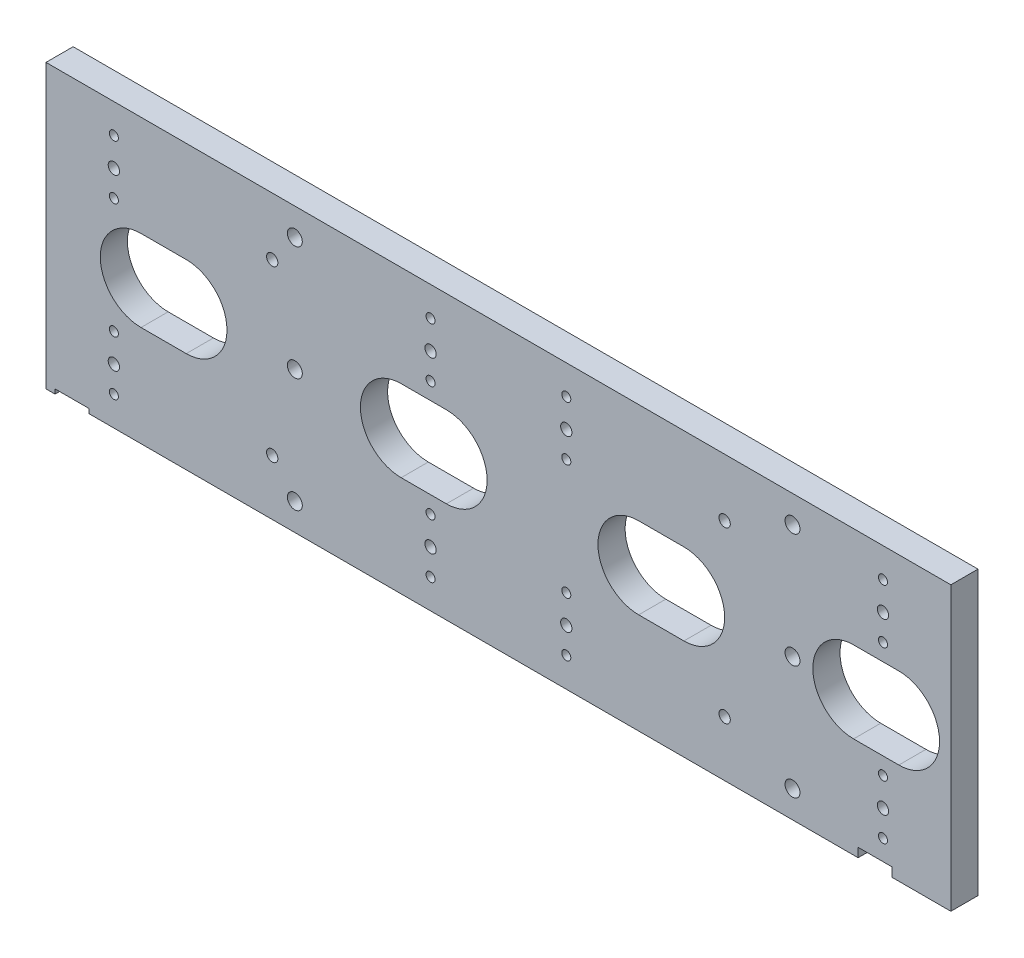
ISO-10303-21;
HEADER;
FILE_DESCRIPTION(('STEP AP214'),'2;1');
FILE_NAME('part.step','',(''),(''),'','','');
FILE_SCHEMA(('AUTOMOTIVE_DESIGN { 1 0 10303 214 1 1 1 1 }'));
ENDSEC;
DATA;
#1=APPLICATION_CONTEXT('core data for automotive mechanical design processes');
#2=APPLICATION_PROTOCOL_DEFINITION('international standard','automotive_design',2000,#1);
#3=PRODUCT_CONTEXT('',#1,'mechanical');
#4=PRODUCT('Part','Part','',(#3));
#5=PRODUCT_RELATED_PRODUCT_CATEGORY('part','',(#4));
#6=PRODUCT_DEFINITION_FORMATION('','',#4);
#7=PRODUCT_DEFINITION_CONTEXT('part definition',#1,'design');
#8=PRODUCT_DEFINITION('design','',#6,#7);
#9=PRODUCT_DEFINITION_SHAPE('','',#8);
#10=(LENGTH_UNIT() NAMED_UNIT(*) SI_UNIT(.MILLI.,.METRE.));
#11=(NAMED_UNIT(*) PLANE_ANGLE_UNIT() SI_UNIT($,.RADIAN.));
#12=(NAMED_UNIT(*) SI_UNIT($,.STERADIAN.) SOLID_ANGLE_UNIT());
#13=UNCERTAINTY_MEASURE_WITH_UNIT(LENGTH_MEASURE(1.E-05),#10,'distance_accuracy_value','');
#14=(GEOMETRIC_REPRESENTATION_CONTEXT(3) GLOBAL_UNCERTAINTY_ASSIGNED_CONTEXT((#13)) GLOBAL_UNIT_ASSIGNED_CONTEXT((#10,
#11,#12)) REPRESENTATION_CONTEXT('',''));
#15=CARTESIAN_POINT('',(0.,0.,0.));
#16=DIRECTION('',(0.,0.,1.));
#17=DIRECTION('',(1.,0.,0.));
#18=AXIS2_PLACEMENT_3D('',#15,#16,#17);
#19=CARTESIAN_POINT('',(-200.,-62.5,12.));
#20=DIRECTION('',(0.,1.,0.));
#21=DIRECTION('',(0.,0.,1.));
#22=AXIS2_PLACEMENT_3D('',#19,#20,#21);
#23=PLANE('',#22);
#24=CARTESIAN_POINT('',(96.5,-62.5,6.));
#25=DIRECTION('',(0.,-1.,0.));
#26=DIRECTION('',(0.,0.,-1.));
#27=AXIS2_PLACEMENT_3D('',#24,#25,#26);
#28=CIRCLE('',#27,2.1);
#29=CARTESIAN_POINT('',(96.5,-62.5,3.9));
#30=VERTEX_POINT('',#29);
#31=EDGE_CURVE('E345',#30,#30,#28,.T.);
#32=ORIENTED_EDGE('',*,*,#31,.F.);
#33=EDGE_LOOP('',(#32));
#34=FACE_BOUND('',#33,.T.);
#35=CARTESIAN_POINT('',(114.5,-62.5,6.));
#36=DIRECTION('',(0.,-1.,0.));
#37=DIRECTION('',(0.,0.,-1.));
#38=AXIS2_PLACEMENT_3D('',#35,#36,#37);
#39=CIRCLE('',#38,2.1);
#40=CARTESIAN_POINT('',(114.5,-62.5,3.9));
#41=VERTEX_POINT('',#40);
#42=EDGE_CURVE('E357',#41,#41,#39,.T.);
#43=ORIENTED_EDGE('',*,*,#42,.F.);
#44=EDGE_LOOP('',(#43));
#45=FACE_BOUND('',#44,.T.);
#46=DIRECTION('',(1.,0.,0.));
#47=VECTOR('',#46,1.);
#48=CARTESIAN_POINT('',(-200.,-62.5,0.));
#49=LINE('',#48,#47);
#50=CARTESIAN_POINT('',(-181.,-62.5,0.));
#51=VERTEX_POINT('',#50);
#52=CARTESIAN_POINT('',(159.,-62.5,0.));
#53=VERTEX_POINT('',#52);
#54=EDGE_CURVE('E691',#51,#53,#49,.T.);
#55=ORIENTED_EDGE('',*,*,#54,.T.);
#56=DIRECTION('',(0.,0.,1.));
#57=VECTOR('',#56,1.);
#58=CARTESIAN_POINT('',(159.,-62.5,0.));
#59=LINE('',#58,#57);
#60=CARTESIAN_POINT('',(159.,-62.5,12.));
#61=VERTEX_POINT('',#60);
#62=EDGE_CURVE('E386',#53,#61,#59,.T.);
#63=ORIENTED_EDGE('',*,*,#62,.T.);
#64=DIRECTION('',(1.,0.,0.));
#65=VECTOR('',#64,1.);
#66=CARTESIAN_POINT('',(-200.,-62.5,12.));
#67=LINE('',#66,#65);
#68=CARTESIAN_POINT('',(-181.,-62.5,12.));
#69=VERTEX_POINT('',#68);
#70=EDGE_CURVE('E681',#69,#61,#67,.T.);
#71=ORIENTED_EDGE('',*,*,#70,.F.);
#72=DIRECTION('',(0.,0.,1.));
#73=VECTOR('',#72,1.);
#74=CARTESIAN_POINT('',(-181.,-62.5,0.));
#75=LINE('',#74,#73);
#76=EDGE_CURVE('E424',#51,#69,#75,.T.);
#77=ORIENTED_EDGE('',*,*,#76,.F.);
#78=EDGE_LOOP('',(#55,#63,#71,#77));
#79=FACE_BOUND('',#78,.T.);
#80=ADVANCED_FACE('F16',(#34,#45,#79),#23,.F.);
#81=CARTESIAN_POINT('',(-200.,-62.5,0.));
#82=VERTEX_POINT('',#81);
#83=CARTESIAN_POINT('',(-196.,-62.5,0.));
#84=VERTEX_POINT('',#83);
#85=EDGE_CURVE('E672',#82,#84,#49,.T.);
#86=ORIENTED_EDGE('',*,*,#85,.T.);
#87=DIRECTION('',(0.,0.,1.));
#88=VECTOR('',#87,1.);
#89=CARTESIAN_POINT('',(-196.,-62.5,0.));
#90=LINE('',#89,#88);
#91=CARTESIAN_POINT('',(-196.,-62.5,12.));
#92=VERTEX_POINT('',#91);
#93=EDGE_CURVE('E412',#84,#92,#90,.T.);
#94=ORIENTED_EDGE('',*,*,#93,.T.);
#95=CARTESIAN_POINT('',(-200.,-62.5,12.));
#96=VERTEX_POINT('',#95);
#97=EDGE_CURVE('E677',#96,#92,#67,.T.);
#98=ORIENTED_EDGE('',*,*,#97,.F.);
#99=DIRECTION('',(0.,0.,-1.));
#100=VECTOR('',#99,1.);
#101=CARTESIAN_POINT('',(-200.,-62.5,12.));
#102=LINE('',#101,#100);
#103=EDGE_CURVE('E694',#96,#82,#102,.T.);
#104=ORIENTED_EDGE('',*,*,#103,.T.);
#105=EDGE_LOOP('',(#86,#94,#98,#104));
#106=FACE_BOUND('',#105,.T.);
#107=ADVANCED_FACE('F711',(#106),#23,.F.);
#108=CARTESIAN_POINT('',(0.,0.,12.));
#109=DIRECTION('',(0.,0.,1.));
#110=DIRECTION('',(1.,0.,0.));
#111=AXIS2_PLACEMENT_3D('',#108,#109,#110);
#112=PLANE('',#111);
#113=CARTESIAN_POINT('',(177.,0.,12.));
#114=DIRECTION('',(0.,0.,-1.));
#115=DIRECTION('',(-1.,0.,0.));
#116=AXIS2_PLACEMENT_3D('',#113,#114,#115);
#117=CIRCLE('',#116,18.);
#118=CARTESIAN_POINT('',(177.,18.,12.));
#119=VERTEX_POINT('',#118);
#120=CARTESIAN_POINT('',(177.,-18.,12.));
#121=VERTEX_POINT('',#120);
#122=EDGE_CURVE('E221',#119,#121,#117,.T.);
#123=ORIENTED_EDGE('',*,*,#122,.T.);
#124=DIRECTION('',(-1.,0.,0.));
#125=VECTOR('',#124,1.);
#126=CARTESIAN_POINT('',(177.,-18.,12.));
#127=LINE('',#126,#125);
#128=CARTESIAN_POINT('',(157.,-18.,12.));
#129=VERTEX_POINT('',#128);
#130=EDGE_CURVE('E230',#121,#129,#127,.T.);
#131=ORIENTED_EDGE('',*,*,#130,.T.);
#132=CARTESIAN_POINT('',(157.,0.,12.));
#133=DIRECTION('',(0.,0.,-1.));
#134=DIRECTION('',(-1.,0.,0.));
#135=AXIS2_PLACEMENT_3D('',#132,#133,#134);
#136=CIRCLE('',#135,18.);
#137=CARTESIAN_POINT('',(157.,18.,12.));
#138=VERTEX_POINT('',#137);
#139=EDGE_CURVE('E37',#129,#138,#136,.T.);
#140=ORIENTED_EDGE('',*,*,#139,.T.);
#141=DIRECTION('',(1.,0.,0.));
#142=VECTOR('',#141,1.);
#143=CARTESIAN_POINT('',(177.,18.,12.));
#144=LINE('',#143,#142);
#145=EDGE_CURVE('E227',#138,#119,#144,.T.);
#146=ORIENTED_EDGE('',*,*,#145,.T.);
#147=EDGE_LOOP('',(#123,#131,#140,#146));
#148=FACE_BOUND('',#147,.T.);
#149=CARTESIAN_POINT('',(-138.,0.,12.));
#150=DIRECTION('',(0.,0.,-1.));
#151=DIRECTION('',(-1.,0.,0.));
#152=AXIS2_PLACEMENT_3D('',#149,#150,#151);
#153=CIRCLE('',#152,18.);
#154=CARTESIAN_POINT('',(-138.,18.,12.));
#155=VERTEX_POINT('',#154);
#156=CARTESIAN_POINT('',(-138.,-18.,12.));
#157=VERTEX_POINT('',#156);
#158=EDGE_CURVE('E256',#155,#157,#153,.T.);
#159=ORIENTED_EDGE('',*,*,#158,.T.);
#160=DIRECTION('',(-1.,0.,0.));
#161=VECTOR('',#160,1.);
#162=CARTESIAN_POINT('',(-138.,-18.,12.));
#163=LINE('',#162,#161);
#164=CARTESIAN_POINT('',(-158.,-18.,12.));
#165=VERTEX_POINT('',#164);
#166=EDGE_CURVE('E259',#157,#165,#163,.T.);
#167=ORIENTED_EDGE('',*,*,#166,.T.);
#168=CARTESIAN_POINT('',(-158.,0.,12.));
#169=DIRECTION('',(0.,0.,-1.));
#170=DIRECTION('',(-1.,0.,0.));
#171=AXIS2_PLACEMENT_3D('',#168,#169,#170);
#172=CIRCLE('',#171,18.);
#173=CARTESIAN_POINT('',(-158.,18.,12.));
#174=VERTEX_POINT('',#173);
#175=EDGE_CURVE('E263',#165,#174,#172,.T.);
#176=ORIENTED_EDGE('',*,*,#175,.T.);
#177=DIRECTION('',(1.,0.,0.));
#178=VECTOR('',#177,1.);
#179=CARTESIAN_POINT('',(-138.,18.,12.));
#180=LINE('',#179,#178);
#181=EDGE_CURVE('E266',#174,#155,#180,.T.);
#182=ORIENTED_EDGE('',*,*,#181,.T.);
#183=EDGE_LOOP('',(#159,#167,#176,#182));
#184=FACE_BOUND('',#183,.T.);
#185=CARTESIAN_POINT('',(-23.,0.,12.));
#186=DIRECTION('',(0.,0.,-1.));
#187=DIRECTION('',(-1.,0.,0.));
#188=AXIS2_PLACEMENT_3D('',#185,#186,#187);
#189=CIRCLE('',#188,18.);
#190=CARTESIAN_POINT('',(-23.,18.,12.));
#191=VERTEX_POINT('',#190);
#192=CARTESIAN_POINT('',(-23.,-18.,12.));
#193=VERTEX_POINT('',#192);
#194=EDGE_CURVE('E288',#191,#193,#189,.T.);
#195=ORIENTED_EDGE('',*,*,#194,.T.);
#196=DIRECTION('',(-1.,0.,0.));
#197=VECTOR('',#196,1.);
#198=CARTESIAN_POINT('',(-23.,-18.,12.));
#199=LINE('',#198,#197);
#200=CARTESIAN_POINT('',(-43.,-18.,12.));
#201=VERTEX_POINT('',#200);
#202=EDGE_CURVE('E291',#193,#201,#199,.T.);
#203=ORIENTED_EDGE('',*,*,#202,.T.);
#204=CARTESIAN_POINT('',(-43.,0.,12.));
#205=DIRECTION('',(0.,0.,-1.));
#206=DIRECTION('',(-1.,0.,0.));
#207=AXIS2_PLACEMENT_3D('',#204,#205,#206);
#208=CIRCLE('',#207,18.);
#209=CARTESIAN_POINT('',(-43.,18.,12.));
#210=VERTEX_POINT('',#209);
#211=EDGE_CURVE('E295',#201,#210,#208,.T.);
#212=ORIENTED_EDGE('',*,*,#211,.T.);
#213=DIRECTION('',(1.,0.,0.));
#214=VECTOR('',#213,1.);
#215=CARTESIAN_POINT('',(-23.,18.,12.));
#216=LINE('',#215,#214);
#217=EDGE_CURVE('E298',#210,#191,#216,.T.);
#218=ORIENTED_EDGE('',*,*,#217,.T.);
#219=EDGE_LOOP('',(#195,#203,#212,#218));
#220=FACE_BOUND('',#219,.T.);
#221=CARTESIAN_POINT('',(82.,0.,12.));
#222=DIRECTION('',(0.,0.,-1.));
#223=DIRECTION('',(-1.,0.,0.));
#224=AXIS2_PLACEMENT_3D('',#221,#222,#223);
#225=CIRCLE('',#224,18.);
#226=CARTESIAN_POINT('',(82.,18.,12.));
#227=VERTEX_POINT('',#226);
#228=CARTESIAN_POINT('',(82.,-18.,12.));
#229=VERTEX_POINT('',#228);
#230=EDGE_CURVE('E320',#227,#229,#225,.T.);
#231=ORIENTED_EDGE('',*,*,#230,.T.);
#232=DIRECTION('',(-1.,0.,0.));
#233=VECTOR('',#232,1.);
#234=CARTESIAN_POINT('',(82.,-18.,12.));
#235=LINE('',#234,#233);
#236=CARTESIAN_POINT('',(62.,-18.,12.));
#237=VERTEX_POINT('',#236);
#238=EDGE_CURVE('E323',#229,#237,#235,.T.);
#239=ORIENTED_EDGE('',*,*,#238,.T.);
#240=CARTESIAN_POINT('',(62.,0.,12.));
#241=DIRECTION('',(0.,0.,-1.));
#242=DIRECTION('',(-1.,0.,0.));
#243=AXIS2_PLACEMENT_3D('',#240,#241,#242);
#244=CIRCLE('',#243,18.);
#245=CARTESIAN_POINT('',(62.,18.,12.));
#246=VERTEX_POINT('',#245);
#247=EDGE_CURVE('E327',#237,#246,#244,.T.);
#248=ORIENTED_EDGE('',*,*,#247,.T.);
#249=DIRECTION('',(1.,0.,0.));
#250=VECTOR('',#249,1.);
#251=CARTESIAN_POINT('',(82.,18.,12.));
#252=LINE('',#251,#250);
#253=EDGE_CURVE('E330',#246,#227,#252,.T.);
#254=ORIENTED_EDGE('',*,*,#253,.T.);
#255=EDGE_LOOP('',(#231,#239,#248,#254));
#256=FACE_BOUND('',#255,.T.);
#257=DIRECTION('',(0.,-1.,0.));
#258=VECTOR('',#257,1.);
#259=CARTESIAN_POINT('',(159.,-62.5,12.));
#260=LINE('',#259,#258);
#261=CARTESIAN_POINT('',(159.,-58.5,12.));
#262=VERTEX_POINT('',#261);
#263=EDGE_CURVE('E375',#262,#61,#260,.T.);
#264=ORIENTED_EDGE('',*,*,#263,.F.);
#265=DIRECTION('',(-1.,0.,0.));
#266=VECTOR('',#265,1.);
#267=CARTESIAN_POINT('',(159.,-58.5,12.));
#268=LINE('',#267,#266);
#269=CARTESIAN_POINT('',(174.,-58.5,12.));
#270=VERTEX_POINT('',#269);
#271=EDGE_CURVE('E380',#270,#262,#268,.T.);
#272=ORIENTED_EDGE('',*,*,#271,.F.);
#273=DIRECTION('',(0.,1.,0.));
#274=VECTOR('',#273,1.);
#275=CARTESIAN_POINT('',(174.,-62.5,12.));
#276=LINE('',#275,#274);
#277=CARTESIAN_POINT('',(174.,-62.5,12.));
#278=VERTEX_POINT('',#277);
#279=EDGE_CURVE('E388',#278,#270,#276,.T.);
#280=ORIENTED_EDGE('',*,*,#279,.F.);
#281=CARTESIAN_POINT('',(200.,-62.5,12.));
#282=VERTEX_POINT('',#281);
#283=EDGE_CURVE('E676',#278,#282,#67,.T.);
#284=ORIENTED_EDGE('',*,*,#283,.T.);
#285=DIRECTION('',(0.,1.,0.));
#286=VECTOR('',#285,1.);
#287=CARTESIAN_POINT('',(200.,62.5,12.));
#288=LINE('',#287,#286);
#289=CARTESIAN_POINT('',(200.,62.5,12.));
#290=VERTEX_POINT('',#289);
#291=EDGE_CURVE('E668',#282,#290,#288,.T.);
#292=ORIENTED_EDGE('',*,*,#291,.T.);
#293=DIRECTION('',(-1.,0.,0.));
#294=VECTOR('',#293,1.);
#295=CARTESIAN_POINT('',(-200.,62.5,12.));
#296=LINE('',#295,#294);
#297=CARTESIAN_POINT('',(-200.,62.5,12.));
#298=VERTEX_POINT('',#297);
#299=EDGE_CURVE('E671',#290,#298,#296,.T.);
#300=ORIENTED_EDGE('',*,*,#299,.T.);
#301=DIRECTION('',(0.,-1.,0.));
#302=VECTOR('',#301,1.);
#303=CARTESIAN_POINT('',(-200.,62.5,12.));
#304=LINE('',#303,#302);
#305=EDGE_CURVE('E674',#298,#96,#304,.T.);
#306=ORIENTED_EDGE('',*,*,#305,.T.);
#307=ORIENTED_EDGE('',*,*,#97,.T.);
#308=DIRECTION('',(0.,-1.,0.));
#309=VECTOR('',#308,1.);
#310=CARTESIAN_POINT('',(-196.,-62.5,12.));
#311=LINE('',#310,#309);
#312=CARTESIAN_POINT('',(-196.,-60.5,12.));
#313=VERTEX_POINT('',#312);
#314=EDGE_CURVE('E395',#313,#92,#311,.T.);
#315=ORIENTED_EDGE('',*,*,#314,.F.);
#316=DIRECTION('',(-1.,0.,0.));
#317=VECTOR('',#316,1.);
#318=CARTESIAN_POINT('',(-196.,-60.5,12.));
#319=LINE('',#318,#317);
#320=CARTESIAN_POINT('',(-181.,-60.5,12.));
#321=VERTEX_POINT('',#320);
#322=EDGE_CURVE('E406',#321,#313,#319,.T.);
#323=ORIENTED_EDGE('',*,*,#322,.F.);
#324=DIRECTION('',(0.,1.,0.));
#325=VECTOR('',#324,1.);
#326=CARTESIAN_POINT('',(-181.,-62.5,12.));
#327=LINE('',#326,#325);
#328=EDGE_CURVE('E414',#69,#321,#327,.T.);
#329=ORIENTED_EDGE('',*,*,#328,.F.);
#330=ORIENTED_EDGE('',*,*,#70,.T.);
#331=EDGE_LOOP('',(#264,#272,#280,#284,#292,#300,#306,#307,#315,#323,#329,#330));
#332=FACE_BOUND('',#331,.T.);
#333=CARTESIAN_POINT('',(-90.,-50.5,12.));
#334=DIRECTION('',(0.,0.,-1.));
#335=DIRECTION('',(-1.,0.,0.));
#336=AXIS2_PLACEMENT_3D('',#333,#334,#335);
#337=CIRCLE('',#336,3.3);
#338=CARTESIAN_POINT('',(-93.3,-50.5,12.));
#339=VERTEX_POINT('',#338);
#340=EDGE_CURVE('E664',#339,#339,#337,.T.);
#341=ORIENTED_EDGE('',*,*,#340,.T.);
#342=EDGE_LOOP('',(#341));
#343=FACE_BOUND('',#342,.T.);
#344=CARTESIAN_POINT('',(-90.,0.,12.));
#345=DIRECTION('',(0.,0.,-1.));
#346=DIRECTION('',(-1.,0.,0.));
#347=AXIS2_PLACEMENT_3D('',#344,#345,#346);
#348=CIRCLE('',#347,3.3);
#349=CARTESIAN_POINT('',(-93.3,0.,12.));
#350=VERTEX_POINT('',#349);
#351=EDGE_CURVE('E652',#350,#350,#348,.T.);
#352=ORIENTED_EDGE('',*,*,#351,.T.);
#353=EDGE_LOOP('',(#352));
#354=FACE_BOUND('',#353,.T.);
#355=CARTESIAN_POINT('',(-90.,50.5,12.));
#356=DIRECTION('',(0.,0.,-1.));
#357=DIRECTION('',(-1.,0.,0.));
#358=AXIS2_PLACEMENT_3D('',#355,#356,#357);
#359=CIRCLE('',#358,3.3);
#360=CARTESIAN_POINT('',(-93.3,50.5,12.));
#361=VERTEX_POINT('',#360);
#362=EDGE_CURVE('E640',#361,#361,#359,.T.);
#363=ORIENTED_EDGE('',*,*,#362,.T.);
#364=EDGE_LOOP('',(#363));
#365=FACE_BOUND('',#364,.T.);
#366=CARTESIAN_POINT('',(130.,-50.5,12.));
#367=DIRECTION('',(0.,0.,-1.));
#368=DIRECTION('',(-1.,0.,0.));
#369=AXIS2_PLACEMENT_3D('',#366,#367,#368);
#370=CIRCLE('',#369,3.3);
#371=CARTESIAN_POINT('',(126.7,-50.5,12.));
#372=VERTEX_POINT('',#371);
#373=EDGE_CURVE('E628',#372,#372,#370,.T.);
#374=ORIENTED_EDGE('',*,*,#373,.T.);
#375=EDGE_LOOP('',(#374));
#376=FACE_BOUND('',#375,.T.);
#377=CARTESIAN_POINT('',(130.,0.,12.));
#378=DIRECTION('',(0.,0.,-1.));
#379=DIRECTION('',(-1.,0.,0.));
#380=AXIS2_PLACEMENT_3D('',#377,#378,#379);
#381=CIRCLE('',#380,3.3);
#382=CARTESIAN_POINT('',(126.7,0.,12.));
#383=VERTEX_POINT('',#382);
#384=EDGE_CURVE('E616',#383,#383,#381,.T.);
#385=ORIENTED_EDGE('',*,*,#384,.T.);
#386=EDGE_LOOP('',(#385));
#387=FACE_BOUND('',#386,.T.);
#388=CARTESIAN_POINT('',(130.,50.5,12.));
#389=DIRECTION('',(0.,0.,-1.));
#390=DIRECTION('',(-1.,0.,0.));
#391=AXIS2_PLACEMENT_3D('',#388,#389,#390);
#392=CIRCLE('',#391,3.3);
#393=CARTESIAN_POINT('',(126.7,50.5,12.));
#394=VERTEX_POINT('',#393);
#395=EDGE_CURVE('E604',#394,#394,#392,.T.);
#396=ORIENTED_EDGE('',*,*,#395,.T.);
#397=EDGE_LOOP('',(#396));
#398=FACE_BOUND('',#397,.T.);
#399=CARTESIAN_POINT('',(170.,37.,12.));
#400=DIRECTION('',(0.,0.,-1.));
#401=DIRECTION('',(-1.,0.,0.));
#402=AXIS2_PLACEMENT_3D('',#399,#400,#401);
#403=CIRCLE('',#402,2.5);
#404=CARTESIAN_POINT('',(167.5,37.,12.));
#405=VERTEX_POINT('',#404);
#406=EDGE_CURVE('E592',#405,#405,#403,.T.);
#407=ORIENTED_EDGE('',*,*,#406,.T.);
#408=EDGE_LOOP('',(#407));
#409=FACE_BOUND('',#408,.T.);
#410=CARTESIAN_POINT('',(100.,37.,12.));
#411=DIRECTION('',(0.,0.,-1.));
#412=DIRECTION('',(-1.,0.,0.));
#413=AXIS2_PLACEMENT_3D('',#410,#411,#412);
#414=CIRCLE('',#413,2.5);
#415=CARTESIAN_POINT('',(97.5,37.,12.));
#416=VERTEX_POINT('',#415);
#417=EDGE_CURVE('E586',#416,#416,#414,.T.);
#418=ORIENTED_EDGE('',*,*,#417,.T.);
#419=EDGE_LOOP('',(#418));
#420=FACE_BOUND('',#419,.T.);
#421=CARTESIAN_POINT('',(30.,37.,12.));
#422=DIRECTION('',(0.,0.,-1.));
#423=DIRECTION('',(-1.,0.,0.));
#424=AXIS2_PLACEMENT_3D('',#421,#422,#423);
#425=CIRCLE('',#424,2.5);
#426=CARTESIAN_POINT('',(27.5,37.,12.));
#427=VERTEX_POINT('',#426);
#428=EDGE_CURVE('E580',#427,#427,#425,.T.);
#429=ORIENTED_EDGE('',*,*,#428,.T.);
#430=EDGE_LOOP('',(#429));
#431=FACE_BOUND('',#430,.T.);
#432=CARTESIAN_POINT('',(-30.,37.,12.));
#433=DIRECTION('',(0.,0.,-1.));
#434=DIRECTION('',(-1.,0.,0.));
#435=AXIS2_PLACEMENT_3D('',#432,#433,#434);
#436=CIRCLE('',#435,2.5);
#437=CARTESIAN_POINT('',(-32.5,37.,12.));
#438=VERTEX_POINT('',#437);
#439=EDGE_CURVE('E574',#438,#438,#436,.T.);
#440=ORIENTED_EDGE('',*,*,#439,.T.);
#441=EDGE_LOOP('',(#440));
#442=FACE_BOUND('',#441,.T.);
#443=CARTESIAN_POINT('',(-100.,37.,12.));
#444=DIRECTION('',(0.,0.,-1.));
#445=DIRECTION('',(-1.,0.,0.));
#446=AXIS2_PLACEMENT_3D('',#443,#444,#445);
#447=CIRCLE('',#446,2.5);
#448=CARTESIAN_POINT('',(-102.5,37.,12.));
#449=VERTEX_POINT('',#448);
#450=EDGE_CURVE('E568',#449,#449,#447,.T.);
#451=ORIENTED_EDGE('',*,*,#450,.T.);
#452=EDGE_LOOP('',(#451));
#453=FACE_BOUND('',#452,.T.);
#454=CARTESIAN_POINT('',(-170.,37.,12.));
#455=DIRECTION('',(0.,0.,-1.));
#456=DIRECTION('',(-1.,0.,0.));
#457=AXIS2_PLACEMENT_3D('',#454,#455,#456);
#458=CIRCLE('',#457,2.5);
#459=CARTESIAN_POINT('',(-172.5,37.,12.));
#460=VERTEX_POINT('',#459);
#461=EDGE_CURVE('E562',#460,#460,#458,.T.);
#462=ORIENTED_EDGE('',*,*,#461,.T.);
#463=EDGE_LOOP('',(#462));
#464=FACE_BOUND('',#463,.T.);
#465=CARTESIAN_POINT('',(-170.,-38.,12.));
#466=DIRECTION('',(0.,0.,-1.));
#467=DIRECTION('',(-1.,0.,0.));
#468=AXIS2_PLACEMENT_3D('',#465,#466,#467);
#469=CIRCLE('',#468,2.5);
#470=CARTESIAN_POINT('',(-172.5,-38.,12.));
#471=VERTEX_POINT('',#470);
#472=EDGE_CURVE('E556',#471,#471,#469,.T.);
#473=ORIENTED_EDGE('',*,*,#472,.T.);
#474=EDGE_LOOP('',(#473));
#475=FACE_BOUND('',#474,.T.);
#476=CARTESIAN_POINT('',(-100.,-38.,12.));
#477=DIRECTION('',(0.,0.,-1.));
#478=DIRECTION('',(-1.,0.,0.));
#479=AXIS2_PLACEMENT_3D('',#476,#477,#478);
#480=CIRCLE('',#479,2.5);
#481=CARTESIAN_POINT('',(-102.5,-38.,12.));
#482=VERTEX_POINT('',#481);
#483=EDGE_CURVE('E550',#482,#482,#480,.T.);
#484=ORIENTED_EDGE('',*,*,#483,.T.);
#485=EDGE_LOOP('',(#484));
#486=FACE_BOUND('',#485,.T.);
#487=CARTESIAN_POINT('',(-30.,-38.,12.));
#488=DIRECTION('',(0.,0.,-1.));
#489=DIRECTION('',(-1.,0.,0.));
#490=AXIS2_PLACEMENT_3D('',#487,#488,#489);
#491=CIRCLE('',#490,2.5);
#492=CARTESIAN_POINT('',(-32.5,-38.,12.));
#493=VERTEX_POINT('',#492);
#494=EDGE_CURVE('E544',#493,#493,#491,.T.);
#495=ORIENTED_EDGE('',*,*,#494,.T.);
#496=EDGE_LOOP('',(#495));
#497=FACE_BOUND('',#496,.T.);
#498=CARTESIAN_POINT('',(30.,-38.,12.));
#499=DIRECTION('',(0.,0.,-1.));
#500=DIRECTION('',(-1.,0.,0.));
#501=AXIS2_PLACEMENT_3D('',#498,#499,#500);
#502=CIRCLE('',#501,2.5);
#503=CARTESIAN_POINT('',(27.5,-38.,12.));
#504=VERTEX_POINT('',#503);
#505=EDGE_CURVE('E538',#504,#504,#502,.T.);
#506=ORIENTED_EDGE('',*,*,#505,.T.);
#507=EDGE_LOOP('',(#506));
#508=FACE_BOUND('',#507,.T.);
#509=CARTESIAN_POINT('',(100.,-38.,12.));
#510=DIRECTION('',(0.,0.,-1.));
#511=DIRECTION('',(-1.,0.,0.));
#512=AXIS2_PLACEMENT_3D('',#509,#510,#511);
#513=CIRCLE('',#512,2.5);
#514=CARTESIAN_POINT('',(97.5,-38.,12.));
#515=VERTEX_POINT('',#514);
#516=EDGE_CURVE('E532',#515,#515,#513,.T.);
#517=ORIENTED_EDGE('',*,*,#516,.T.);
#518=EDGE_LOOP('',(#517));
#519=FACE_BOUND('',#518,.T.);
#520=CARTESIAN_POINT('',(170.,-38.,12.));
#521=DIRECTION('',(0.,0.,-1.));
#522=DIRECTION('',(-1.,0.,0.));
#523=AXIS2_PLACEMENT_3D('',#520,#521,#522);
#524=CIRCLE('',#523,2.5);
#525=CARTESIAN_POINT('',(167.5,-38.,12.));
#526=VERTEX_POINT('',#525);
#527=EDGE_CURVE('E526',#526,#526,#524,.T.);
#528=ORIENTED_EDGE('',*,*,#527,.T.);
#529=EDGE_LOOP('',(#528));
#530=FACE_BOUND('',#529,.T.);
#531=CARTESIAN_POINT('',(170.,49.5,12.));
#532=DIRECTION('',(0.,0.,-1.));
#533=DIRECTION('',(-1.,0.,0.));
#534=AXIS2_PLACEMENT_3D('',#531,#532,#533);
#535=CIRCLE('',#534,2.);
#536=CARTESIAN_POINT('',(168.,49.5,12.));
#537=VERTEX_POINT('',#536);
#538=EDGE_CURVE('E520',#537,#537,#535,.T.);
#539=ORIENTED_EDGE('',*,*,#538,.T.);
#540=EDGE_LOOP('',(#539));
#541=FACE_BOUND('',#540,.T.);
#542=CARTESIAN_POINT('',(170.,25.5,12.));
#543=DIRECTION('',(0.,0.,-1.));
#544=DIRECTION('',(-1.,0.,0.));
#545=AXIS2_PLACEMENT_3D('',#542,#543,#544);
#546=CIRCLE('',#545,2.);
#547=CARTESIAN_POINT('',(168.,25.5,12.));
#548=VERTEX_POINT('',#547);
#549=EDGE_CURVE('E514',#548,#548,#546,.T.);
#550=ORIENTED_EDGE('',*,*,#549,.T.);
#551=EDGE_LOOP('',(#550));
#552=FACE_BOUND('',#551,.T.);
#553=CARTESIAN_POINT('',(30.,49.5,12.));
#554=DIRECTION('',(0.,0.,-1.));
#555=DIRECTION('',(-1.,0.,0.));
#556=AXIS2_PLACEMENT_3D('',#553,#554,#555);
#557=CIRCLE('',#556,2.);
#558=CARTESIAN_POINT('',(28.,49.5,12.));
#559=VERTEX_POINT('',#558);
#560=EDGE_CURVE('E508',#559,#559,#557,.T.);
#561=ORIENTED_EDGE('',*,*,#560,.T.);
#562=EDGE_LOOP('',(#561));
#563=FACE_BOUND('',#562,.T.);
#564=CARTESIAN_POINT('',(30.,25.5,12.));
#565=DIRECTION('',(0.,0.,-1.));
#566=DIRECTION('',(-1.,0.,0.));
#567=AXIS2_PLACEMENT_3D('',#564,#565,#566);
#568=CIRCLE('',#567,2.);
#569=CARTESIAN_POINT('',(28.,25.5,12.));
#570=VERTEX_POINT('',#569);
#571=EDGE_CURVE('E502',#570,#570,#568,.T.);
#572=ORIENTED_EDGE('',*,*,#571,.T.);
#573=EDGE_LOOP('',(#572));
#574=FACE_BOUND('',#573,.T.);
#575=CARTESIAN_POINT('',(-30.,25.5,12.));
#576=DIRECTION('',(0.,0.,-1.));
#577=DIRECTION('',(-1.,0.,0.));
#578=AXIS2_PLACEMENT_3D('',#575,#576,#577);
#579=CIRCLE('',#578,2.);
#580=CARTESIAN_POINT('',(-32.,25.5,12.));
#581=VERTEX_POINT('',#580);
#582=EDGE_CURVE('E496',#581,#581,#579,.T.);
#583=ORIENTED_EDGE('',*,*,#582,.T.);
#584=EDGE_LOOP('',(#583));
#585=FACE_BOUND('',#584,.T.);
#586=CARTESIAN_POINT('',(-30.,49.5,12.));
#587=DIRECTION('',(0.,0.,-1.));
#588=DIRECTION('',(-1.,0.,0.));
#589=AXIS2_PLACEMENT_3D('',#586,#587,#588);
#590=CIRCLE('',#589,2.);
#591=CARTESIAN_POINT('',(-32.,49.5,12.));
#592=VERTEX_POINT('',#591);
#593=EDGE_CURVE('E490',#592,#592,#590,.T.);
#594=ORIENTED_EDGE('',*,*,#593,.T.);
#595=EDGE_LOOP('',(#594));
#596=FACE_BOUND('',#595,.T.);
#597=CARTESIAN_POINT('',(-170.,49.5,12.));
#598=DIRECTION('',(0.,0.,-1.));
#599=DIRECTION('',(-1.,0.,0.));
#600=AXIS2_PLACEMENT_3D('',#597,#598,#599);
#601=CIRCLE('',#600,2.);
#602=CARTESIAN_POINT('',(-172.,49.5,12.));
#603=VERTEX_POINT('',#602);
#604=EDGE_CURVE('E484',#603,#603,#601,.T.);
#605=ORIENTED_EDGE('',*,*,#604,.T.);
#606=EDGE_LOOP('',(#605));
#607=FACE_BOUND('',#606,.T.);
#608=CARTESIAN_POINT('',(-170.,25.5,12.));
#609=DIRECTION('',(0.,0.,-1.));
#610=DIRECTION('',(-1.,0.,0.));
#611=AXIS2_PLACEMENT_3D('',#608,#609,#610);
#612=CIRCLE('',#611,2.);
#613=CARTESIAN_POINT('',(-172.,25.5,12.));
#614=VERTEX_POINT('',#613);
#615=EDGE_CURVE('E478',#614,#614,#612,.T.);
#616=ORIENTED_EDGE('',*,*,#615,.T.);
#617=EDGE_LOOP('',(#616));
#618=FACE_BOUND('',#617,.T.);
#619=CARTESIAN_POINT('',(-170.,-25.5,12.));
#620=DIRECTION('',(0.,0.,-1.));
#621=DIRECTION('',(-1.,0.,0.));
#622=AXIS2_PLACEMENT_3D('',#619,#620,#621);
#623=CIRCLE('',#622,2.);
#624=CARTESIAN_POINT('',(-172.,-25.5,12.));
#625=VERTEX_POINT('',#624);
#626=EDGE_CURVE('E472',#625,#625,#623,.T.);
#627=ORIENTED_EDGE('',*,*,#626,.T.);
#628=EDGE_LOOP('',(#627));
#629=FACE_BOUND('',#628,.T.);
#630=CARTESIAN_POINT('',(-170.,-49.5,12.));
#631=DIRECTION('',(0.,0.,-1.));
#632=DIRECTION('',(-1.,0.,0.));
#633=AXIS2_PLACEMENT_3D('',#630,#631,#632);
#634=CIRCLE('',#633,2.);
#635=CARTESIAN_POINT('',(-172.,-49.5,12.));
#636=VERTEX_POINT('',#635);
#637=EDGE_CURVE('E466',#636,#636,#634,.T.);
#638=ORIENTED_EDGE('',*,*,#637,.T.);
#639=EDGE_LOOP('',(#638));
#640=FACE_BOUND('',#639,.T.);
#641=CARTESIAN_POINT('',(-30.,-25.5,12.));
#642=DIRECTION('',(0.,0.,-1.));
#643=DIRECTION('',(-1.,0.,0.));
#644=AXIS2_PLACEMENT_3D('',#641,#642,#643);
#645=CIRCLE('',#644,2.);
#646=CARTESIAN_POINT('',(-32.,-25.5,12.));
#647=VERTEX_POINT('',#646);
#648=EDGE_CURVE('E460',#647,#647,#645,.T.);
#649=ORIENTED_EDGE('',*,*,#648,.T.);
#650=EDGE_LOOP('',(#649));
#651=FACE_BOUND('',#650,.T.);
#652=CARTESIAN_POINT('',(-30.,-49.5,12.));
#653=DIRECTION('',(0.,0.,-1.));
#654=DIRECTION('',(-1.,0.,0.));
#655=AXIS2_PLACEMENT_3D('',#652,#653,#654);
#656=CIRCLE('',#655,2.);
#657=CARTESIAN_POINT('',(-32.,-49.5,12.));
#658=VERTEX_POINT('',#657);
#659=EDGE_CURVE('E454',#658,#658,#656,.T.);
#660=ORIENTED_EDGE('',*,*,#659,.T.);
#661=EDGE_LOOP('',(#660));
#662=FACE_BOUND('',#661,.T.);
#663=CARTESIAN_POINT('',(30.,-25.5,12.));
#664=DIRECTION('',(0.,0.,-1.));
#665=DIRECTION('',(-1.,0.,0.));
#666=AXIS2_PLACEMENT_3D('',#663,#664,#665);
#667=CIRCLE('',#666,2.);
#668=CARTESIAN_POINT('',(28.,-25.5,12.));
#669=VERTEX_POINT('',#668);
#670=EDGE_CURVE('E448',#669,#669,#667,.T.);
#671=ORIENTED_EDGE('',*,*,#670,.T.);
#672=EDGE_LOOP('',(#671));
#673=FACE_BOUND('',#672,.T.);
#674=CARTESIAN_POINT('',(30.,-49.5,12.));
#675=DIRECTION('',(0.,0.,-1.));
#676=DIRECTION('',(-1.,0.,0.));
#677=AXIS2_PLACEMENT_3D('',#674,#675,#676);
#678=CIRCLE('',#677,2.);
#679=CARTESIAN_POINT('',(28.,-49.5,12.));
#680=VERTEX_POINT('',#679);
#681=EDGE_CURVE('E442',#680,#680,#678,.T.);
#682=ORIENTED_EDGE('',*,*,#681,.T.);
#683=EDGE_LOOP('',(#682));
#684=FACE_BOUND('',#683,.T.);
#685=CARTESIAN_POINT('',(170.,-25.5,12.));
#686=DIRECTION('',(0.,0.,-1.));
#687=DIRECTION('',(-1.,0.,0.));
#688=AXIS2_PLACEMENT_3D('',#685,#686,#687);
#689=CIRCLE('',#688,2.);
#690=CARTESIAN_POINT('',(168.,-25.5,12.));
#691=VERTEX_POINT('',#690);
#692=EDGE_CURVE('E436',#691,#691,#689,.T.);
#693=ORIENTED_EDGE('',*,*,#692,.T.);
#694=EDGE_LOOP('',(#693));
#695=FACE_BOUND('',#694,.T.);
#696=CARTESIAN_POINT('',(170.,-49.5,12.));
#697=DIRECTION('',(0.,0.,-1.));
#698=DIRECTION('',(-1.,0.,0.));
#699=AXIS2_PLACEMENT_3D('',#696,#697,#698);
#700=CIRCLE('',#699,2.);
#701=CARTESIAN_POINT('',(168.,-49.5,12.));
#702=VERTEX_POINT('',#701);
#703=EDGE_CURVE('E430',#702,#702,#700,.T.);
#704=ORIENTED_EDGE('',*,*,#703,.T.);
#705=EDGE_LOOP('',(#704));
#706=FACE_BOUND('',#705,.T.);
#707=ADVANCED_FACE('F234',(#148,#184,#220,#256,#332,#343,#354,#365,#376,#387,#398,#409,#420,
#431,#442,#453,#464,#475,#486,#497,#508,#519,#530,#541,#552,#563,#574,#585,#596,#607,#618,#629,
#640,#651,#662,#673,#684,#695,#706),#112,.T.);
#708=CARTESIAN_POINT('',(200.,62.5,12.));
#709=DIRECTION('',(-1.,0.,0.));
#710=DIRECTION('',(0.,0.,1.));
#711=AXIS2_PLACEMENT_3D('',#708,#709,#710);
#712=PLANE('',#711);
#713=DIRECTION('',(0.,1.,0.));
#714=VECTOR('',#713,1.);
#715=CARTESIAN_POINT('',(200.,62.5,0.));
#716=LINE('',#715,#714);
#717=CARTESIAN_POINT('',(200.,-62.5,0.));
#718=VERTEX_POINT('',#717);
#719=CARTESIAN_POINT('',(200.,62.5,0.));
#720=VERTEX_POINT('',#719);
#721=EDGE_CURVE('E667',#718,#720,#716,.T.);
#722=ORIENTED_EDGE('',*,*,#721,.T.);
#723=DIRECTION('',(0.,0.,-1.));
#724=VECTOR('',#723,1.);
#725=CARTESIAN_POINT('',(200.,62.5,12.));
#726=LINE('',#725,#724);
#727=EDGE_CURVE('E11',#290,#720,#726,.T.);
#728=ORIENTED_EDGE('',*,*,#727,.F.);
#729=ORIENTED_EDGE('',*,*,#291,.F.);
#730=DIRECTION('',(0.,0.,-1.));
#731=VECTOR('',#730,1.);
#732=CARTESIAN_POINT('',(200.,-62.5,12.));
#733=LINE('',#732,#731);
#734=EDGE_CURVE('E680',#282,#718,#733,.T.);
#735=ORIENTED_EDGE('',*,*,#734,.T.);
#736=EDGE_LOOP('',(#722,#728,#729,#735));
#737=FACE_BOUND('',#736,.T.);
#738=ADVANCED_FACE('F18',(#737),#712,.F.);
#739=CARTESIAN_POINT('',(-200.,62.5,12.));
#740=DIRECTION('',(0.,-1.,0.));
#741=DIRECTION('',(0.,0.,-1.));
#742=AXIS2_PLACEMENT_3D('',#739,#740,#741);
#743=PLANE('',#742);
#744=DIRECTION('',(-1.,0.,0.));
#745=VECTOR('',#744,1.);
#746=CARTESIAN_POINT('',(-200.,62.5,0.));
#747=LINE('',#746,#745);
#748=CARTESIAN_POINT('',(-200.,62.5,0.));
#749=VERTEX_POINT('',#748);
#750=EDGE_CURVE('E684',#720,#749,#747,.T.);
#751=ORIENTED_EDGE('',*,*,#750,.T.);
#752=DIRECTION('',(0.,0.,-1.));
#753=VECTOR('',#752,1.);
#754=CARTESIAN_POINT('',(-200.,62.5,12.));
#755=LINE('',#754,#753);
#756=EDGE_CURVE('E30',#298,#749,#755,.T.);
#757=ORIENTED_EDGE('',*,*,#756,.F.);
#758=ORIENTED_EDGE('',*,*,#299,.F.);
#759=ORIENTED_EDGE('',*,*,#727,.T.);
#760=EDGE_LOOP('',(#751,#757,#758,#759));
#761=FACE_BOUND('',#760,.T.);
#762=ADVANCED_FACE('F720',(#761),#743,.F.);
#763=CARTESIAN_POINT('',(-200.,62.5,12.));
#764=DIRECTION('',(1.,0.,0.));
#765=DIRECTION('',(0.,1.,0.));
#766=AXIS2_PLACEMENT_3D('',#763,#764,#765);
#767=PLANE('',#766);
#768=DIRECTION('',(0.,-1.,0.));
#769=VECTOR('',#768,1.);
#770=CARTESIAN_POINT('',(-200.,62.5,0.));
#771=LINE('',#770,#769);
#772=EDGE_CURVE('E686',#749,#82,#771,.T.);
#773=ORIENTED_EDGE('',*,*,#772,.T.);
#774=ORIENTED_EDGE('',*,*,#103,.F.);
#775=ORIENTED_EDGE('',*,*,#305,.F.);
#776=ORIENTED_EDGE('',*,*,#756,.T.);
#777=EDGE_LOOP('',(#773,#774,#775,#776));
#778=FACE_BOUND('',#777,.T.);
#779=ADVANCED_FACE('F702',(#778),#767,.F.);
#780=ORIENTED_EDGE('',*,*,#283,.F.);
#781=DIRECTION('',(0.,0.,1.));
#782=VECTOR('',#781,1.);
#783=CARTESIAN_POINT('',(174.,-62.5,0.));
#784=LINE('',#783,#782);
#785=CARTESIAN_POINT('',(174.,-62.5,0.));
#786=VERTEX_POINT('',#785);
#787=EDGE_CURVE('E398',#786,#278,#784,.T.);
#788=ORIENTED_EDGE('',*,*,#787,.F.);
#789=EDGE_CURVE('E688',#786,#718,#49,.T.);
#790=ORIENTED_EDGE('',*,*,#789,.T.);
#791=ORIENTED_EDGE('',*,*,#734,.F.);
#792=EDGE_LOOP('',(#780,#788,#790,#791));
#793=FACE_BOUND('',#792,.T.);
#794=ADVANCED_FACE('F739',(#793),#23,.F.);
#795=CARTESIAN_POINT('',(0.,0.,0.));
#796=DIRECTION('',(0.,0.,1.));
#797=DIRECTION('',(1.,0.,0.));
#798=AXIS2_PLACEMENT_3D('',#795,#796,#797);
#799=PLANE('',#798);
#800=DIRECTION('',(-1.,0.,0.));
#801=VECTOR('',#800,1.);
#802=CARTESIAN_POINT('',(177.,-18.,0.));
#803=LINE('',#802,#801);
#804=CARTESIAN_POINT('',(177.,-18.,0.));
#805=VERTEX_POINT('',#804);
#806=CARTESIAN_POINT('',(157.,-18.,0.));
#807=VERTEX_POINT('',#806);
#808=EDGE_CURVE('E246',#805,#807,#803,.T.);
#809=ORIENTED_EDGE('',*,*,#808,.F.);
#810=CARTESIAN_POINT('',(177.,0.,0.));
#811=DIRECTION('',(0.,0.,-1.));
#812=DIRECTION('',(-1.,0.,0.));
#813=AXIS2_PLACEMENT_3D('',#810,#811,#812);
#814=CIRCLE('',#813,18.);
#815=CARTESIAN_POINT('',(177.,18.,0.));
#816=VERTEX_POINT('',#815);
#817=EDGE_CURVE('E45',#816,#805,#814,.T.);
#818=ORIENTED_EDGE('',*,*,#817,.F.);
#819=DIRECTION('',(1.,0.,0.));
#820=VECTOR('',#819,1.);
#821=CARTESIAN_POINT('',(177.,18.,0.));
#822=LINE('',#821,#820);
#823=CARTESIAN_POINT('',(157.,18.,0.));
#824=VERTEX_POINT('',#823);
#825=EDGE_CURVE('E237',#824,#816,#822,.T.);
#826=ORIENTED_EDGE('',*,*,#825,.F.);
#827=CARTESIAN_POINT('',(157.,0.,0.));
#828=DIRECTION('',(0.,0.,-1.));
#829=DIRECTION('',(-1.,0.,0.));
#830=AXIS2_PLACEMENT_3D('',#827,#828,#829);
#831=CIRCLE('',#830,18.);
#832=EDGE_CURVE('E240',#807,#824,#831,.T.);
#833=ORIENTED_EDGE('',*,*,#832,.F.);
#834=EDGE_LOOP('',(#809,#818,#826,#833));
#835=FACE_BOUND('',#834,.T.);
#836=DIRECTION('',(-1.,0.,0.));
#837=VECTOR('',#836,1.);
#838=CARTESIAN_POINT('',(-138.,-18.,0.));
#839=LINE('',#838,#837);
#840=CARTESIAN_POINT('',(-138.,-18.,0.));
#841=VERTEX_POINT('',#840);
#842=CARTESIAN_POINT('',(-158.,-18.,0.));
#843=VERTEX_POINT('',#842);
#844=EDGE_CURVE('E271',#841,#843,#839,.T.);
#845=ORIENTED_EDGE('',*,*,#844,.F.);
#846=CARTESIAN_POINT('',(-138.,0.,0.));
#847=DIRECTION('',(0.,0.,-1.));
#848=DIRECTION('',(-1.,0.,0.));
#849=AXIS2_PLACEMENT_3D('',#846,#847,#848);
#850=CIRCLE('',#849,18.);
#851=CARTESIAN_POINT('',(-138.,18.,0.));
#852=VERTEX_POINT('',#851);
#853=EDGE_CURVE('E252',#852,#841,#850,.T.);
#854=ORIENTED_EDGE('',*,*,#853,.F.);
#855=DIRECTION('',(1.,0.,0.));
#856=VECTOR('',#855,1.);
#857=CARTESIAN_POINT('',(-138.,18.,0.));
#858=LINE('',#857,#856);
#859=CARTESIAN_POINT('',(-158.,18.,0.));
#860=VERTEX_POINT('',#859);
#861=EDGE_CURVE('E260',#860,#852,#858,.T.);
#862=ORIENTED_EDGE('',*,*,#861,.F.);
#863=CARTESIAN_POINT('',(-158.,0.,0.));
#864=DIRECTION('',(0.,0.,-1.));
#865=DIRECTION('',(-1.,0.,0.));
#866=AXIS2_PLACEMENT_3D('',#863,#864,#865);
#867=CIRCLE('',#866,18.);
#868=EDGE_CURVE('E274',#843,#860,#867,.T.);
#869=ORIENTED_EDGE('',*,*,#868,.F.);
#870=EDGE_LOOP('',(#845,#854,#862,#869));
#871=FACE_BOUND('',#870,.T.);
#872=DIRECTION('',(-1.,0.,0.));
#873=VECTOR('',#872,1.);
#874=CARTESIAN_POINT('',(-23.,-18.,0.));
#875=LINE('',#874,#873);
#876=CARTESIAN_POINT('',(-23.,-18.,0.));
#877=VERTEX_POINT('',#876);
#878=CARTESIAN_POINT('',(-43.,-18.,0.));
#879=VERTEX_POINT('',#878);
#880=EDGE_CURVE('E303',#877,#879,#875,.T.);
#881=ORIENTED_EDGE('',*,*,#880,.F.);
#882=CARTESIAN_POINT('',(-23.,0.,0.));
#883=DIRECTION('',(0.,0.,-1.));
#884=DIRECTION('',(-1.,0.,0.));
#885=AXIS2_PLACEMENT_3D('',#882,#883,#884);
#886=CIRCLE('',#885,18.);
#887=CARTESIAN_POINT('',(-23.,18.,0.));
#888=VERTEX_POINT('',#887);
#889=EDGE_CURVE('E281',#888,#877,#886,.T.);
#890=ORIENTED_EDGE('',*,*,#889,.F.);
#891=DIRECTION('',(1.,0.,0.));
#892=VECTOR('',#891,1.);
#893=CARTESIAN_POINT('',(-23.,18.,0.));
#894=LINE('',#893,#892);
#895=CARTESIAN_POINT('',(-43.,18.,0.));
#896=VERTEX_POINT('',#895);
#897=EDGE_CURVE('E292',#896,#888,#894,.T.);
#898=ORIENTED_EDGE('',*,*,#897,.F.);
#899=CARTESIAN_POINT('',(-43.,0.,0.));
#900=DIRECTION('',(0.,0.,-1.));
#901=DIRECTION('',(-1.,0.,0.));
#902=AXIS2_PLACEMENT_3D('',#899,#900,#901);
#903=CIRCLE('',#902,18.);
#904=EDGE_CURVE('E306',#879,#896,#903,.T.);
#905=ORIENTED_EDGE('',*,*,#904,.F.);
#906=EDGE_LOOP('',(#881,#890,#898,#905));
#907=FACE_BOUND('',#906,.T.);
#908=DIRECTION('',(-1.,0.,0.));
#909=VECTOR('',#908,1.);
#910=CARTESIAN_POINT('',(82.,-18.,0.));
#911=LINE('',#910,#909);
#912=CARTESIAN_POINT('',(82.,-18.,0.));
#913=VERTEX_POINT('',#912);
#914=CARTESIAN_POINT('',(62.,-18.,0.));
#915=VERTEX_POINT('',#914);
#916=EDGE_CURVE('E335',#913,#915,#911,.T.);
#917=ORIENTED_EDGE('',*,*,#916,.F.);
#918=CARTESIAN_POINT('',(82.,0.,0.));
#919=DIRECTION('',(0.,0.,-1.));
#920=DIRECTION('',(-1.,0.,0.));
#921=AXIS2_PLACEMENT_3D('',#918,#919,#920);
#922=CIRCLE('',#921,18.);
#923=CARTESIAN_POINT('',(82.,18.,0.));
#924=VERTEX_POINT('',#923);
#925=EDGE_CURVE('E313',#924,#913,#922,.T.);
#926=ORIENTED_EDGE('',*,*,#925,.F.);
#927=DIRECTION('',(1.,0.,0.));
#928=VECTOR('',#927,1.);
#929=CARTESIAN_POINT('',(82.,18.,0.));
#930=LINE('',#929,#928);
#931=CARTESIAN_POINT('',(62.,18.,0.));
#932=VERTEX_POINT('',#931);
#933=EDGE_CURVE('E324',#932,#924,#930,.T.);
#934=ORIENTED_EDGE('',*,*,#933,.F.);
#935=CARTESIAN_POINT('',(62.,0.,0.));
#936=DIRECTION('',(0.,0.,-1.));
#937=DIRECTION('',(-1.,0.,0.));
#938=AXIS2_PLACEMENT_3D('',#935,#936,#937);
#939=CIRCLE('',#938,18.);
#940=EDGE_CURVE('E338',#915,#932,#939,.T.);
#941=ORIENTED_EDGE('',*,*,#940,.F.);
#942=EDGE_LOOP('',(#917,#926,#934,#941));
#943=FACE_BOUND('',#942,.T.);
#944=CARTESIAN_POINT('',(170.,-49.5,0.));
#945=DIRECTION('',(0.,0.,-1.));
#946=DIRECTION('',(-1.,0.,0.));
#947=AXIS2_PLACEMENT_3D('',#944,#945,#946);
#948=CIRCLE('',#947,2.);
#949=CARTESIAN_POINT('',(168.,-49.5,0.));
#950=VERTEX_POINT('',#949);
#951=EDGE_CURVE('E421',#950,#950,#948,.T.);
#952=ORIENTED_EDGE('',*,*,#951,.F.);
#953=EDGE_LOOP('',(#952));
#954=FACE_BOUND('',#953,.T.);
#955=CARTESIAN_POINT('',(170.,-25.5,0.));
#956=DIRECTION('',(0.,0.,-1.));
#957=DIRECTION('',(-1.,0.,0.));
#958=AXIS2_PLACEMENT_3D('',#955,#956,#957);
#959=CIRCLE('',#958,2.);
#960=CARTESIAN_POINT('',(168.,-25.5,0.));
#961=VERTEX_POINT('',#960);
#962=EDGE_CURVE('E433',#961,#961,#959,.T.);
#963=ORIENTED_EDGE('',*,*,#962,.F.);
#964=EDGE_LOOP('',(#963));
#965=FACE_BOUND('',#964,.T.);
#966=CARTESIAN_POINT('',(30.,-49.5,0.));
#967=DIRECTION('',(0.,0.,-1.));
#968=DIRECTION('',(-1.,0.,0.));
#969=AXIS2_PLACEMENT_3D('',#966,#967,#968);
#970=CIRCLE('',#969,2.);
#971=CARTESIAN_POINT('',(28.,-49.5,0.));
#972=VERTEX_POINT('',#971);
#973=EDGE_CURVE('E439',#972,#972,#970,.T.);
#974=ORIENTED_EDGE('',*,*,#973,.F.);
#975=EDGE_LOOP('',(#974));
#976=FACE_BOUND('',#975,.T.);
#977=CARTESIAN_POINT('',(30.,-25.5,0.));
#978=DIRECTION('',(0.,0.,-1.));
#979=DIRECTION('',(-1.,0.,0.));
#980=AXIS2_PLACEMENT_3D('',#977,#978,#979);
#981=CIRCLE('',#980,2.);
#982=CARTESIAN_POINT('',(28.,-25.5,0.));
#983=VERTEX_POINT('',#982);
#984=EDGE_CURVE('E445',#983,#983,#981,.T.);
#985=ORIENTED_EDGE('',*,*,#984,.F.);
#986=EDGE_LOOP('',(#985));
#987=FACE_BOUND('',#986,.T.);
#988=CARTESIAN_POINT('',(-30.,-49.5,0.));
#989=DIRECTION('',(0.,0.,-1.));
#990=DIRECTION('',(-1.,0.,0.));
#991=AXIS2_PLACEMENT_3D('',#988,#989,#990);
#992=CIRCLE('',#991,2.);
#993=CARTESIAN_POINT('',(-32.,-49.5,0.));
#994=VERTEX_POINT('',#993);
#995=EDGE_CURVE('E451',#994,#994,#992,.T.);
#996=ORIENTED_EDGE('',*,*,#995,.F.);
#997=EDGE_LOOP('',(#996));
#998=FACE_BOUND('',#997,.T.);
#999=CARTESIAN_POINT('',(-30.,-25.5,0.));
#1000=DIRECTION('',(0.,0.,-1.));
#1001=DIRECTION('',(-1.,0.,0.));
#1002=AXIS2_PLACEMENT_3D('',#999,#1000,#1001);
#1003=CIRCLE('',#1002,2.);
#1004=CARTESIAN_POINT('',(-32.,-25.5,0.));
#1005=VERTEX_POINT('',#1004);
#1006=EDGE_CURVE('E457',#1005,#1005,#1003,.T.);
#1007=ORIENTED_EDGE('',*,*,#1006,.F.);
#1008=EDGE_LOOP('',(#1007));
#1009=FACE_BOUND('',#1008,.T.);
#1010=CARTESIAN_POINT('',(-170.,-49.5,0.));
#1011=DIRECTION('',(0.,0.,-1.));
#1012=DIRECTION('',(-1.,0.,0.));
#1013=AXIS2_PLACEMENT_3D('',#1010,#1011,#1012);
#1014=CIRCLE('',#1013,2.);
#1015=CARTESIAN_POINT('',(-172.,-49.5,0.));
#1016=VERTEX_POINT('',#1015);
#1017=EDGE_CURVE('E463',#1016,#1016,#1014,.T.);
#1018=ORIENTED_EDGE('',*,*,#1017,.F.);
#1019=EDGE_LOOP('',(#1018));
#1020=FACE_BOUND('',#1019,.T.);
#1021=CARTESIAN_POINT('',(-170.,-25.5,0.));
#1022=DIRECTION('',(0.,0.,-1.));
#1023=DIRECTION('',(-1.,0.,0.));
#1024=AXIS2_PLACEMENT_3D('',#1021,#1022,#1023);
#1025=CIRCLE('',#1024,2.);
#1026=CARTESIAN_POINT('',(-172.,-25.5,0.));
#1027=VERTEX_POINT('',#1026);
#1028=EDGE_CURVE('E469',#1027,#1027,#1025,.T.);
#1029=ORIENTED_EDGE('',*,*,#1028,.F.);
#1030=EDGE_LOOP('',(#1029));
#1031=FACE_BOUND('',#1030,.T.);
#1032=CARTESIAN_POINT('',(-170.,25.5,0.));
#1033=DIRECTION('',(0.,0.,-1.));
#1034=DIRECTION('',(-1.,0.,0.));
#1035=AXIS2_PLACEMENT_3D('',#1032,#1033,#1034);
#1036=CIRCLE('',#1035,2.);
#1037=CARTESIAN_POINT('',(-172.,25.5,0.));
#1038=VERTEX_POINT('',#1037);
#1039=EDGE_CURVE('E475',#1038,#1038,#1036,.T.);
#1040=ORIENTED_EDGE('',*,*,#1039,.F.);
#1041=EDGE_LOOP('',(#1040));
#1042=FACE_BOUND('',#1041,.T.);
#1043=CARTESIAN_POINT('',(-170.,49.5,0.));
#1044=DIRECTION('',(0.,0.,-1.));
#1045=DIRECTION('',(-1.,0.,0.));
#1046=AXIS2_PLACEMENT_3D('',#1043,#1044,#1045);
#1047=CIRCLE('',#1046,2.);
#1048=CARTESIAN_POINT('',(-172.,49.5,0.));
#1049=VERTEX_POINT('',#1048);
#1050=EDGE_CURVE('E481',#1049,#1049,#1047,.T.);
#1051=ORIENTED_EDGE('',*,*,#1050,.F.);
#1052=EDGE_LOOP('',(#1051));
#1053=FACE_BOUND('',#1052,.T.);
#1054=CARTESIAN_POINT('',(-30.,49.5,0.));
#1055=DIRECTION('',(0.,0.,-1.));
#1056=DIRECTION('',(-1.,0.,0.));
#1057=AXIS2_PLACEMENT_3D('',#1054,#1055,#1056);
#1058=CIRCLE('',#1057,2.);
#1059=CARTESIAN_POINT('',(-32.,49.5,0.));
#1060=VERTEX_POINT('',#1059);
#1061=EDGE_CURVE('E487',#1060,#1060,#1058,.T.);
#1062=ORIENTED_EDGE('',*,*,#1061,.F.);
#1063=EDGE_LOOP('',(#1062));
#1064=FACE_BOUND('',#1063,.T.);
#1065=CARTESIAN_POINT('',(-30.,25.5,0.));
#1066=DIRECTION('',(0.,0.,-1.));
#1067=DIRECTION('',(-1.,0.,0.));
#1068=AXIS2_PLACEMENT_3D('',#1065,#1066,#1067);
#1069=CIRCLE('',#1068,2.);
#1070=CARTESIAN_POINT('',(-32.,25.5,0.));
#1071=VERTEX_POINT('',#1070);
#1072=EDGE_CURVE('E493',#1071,#1071,#1069,.T.);
#1073=ORIENTED_EDGE('',*,*,#1072,.F.);
#1074=EDGE_LOOP('',(#1073));
#1075=FACE_BOUND('',#1074,.T.);
#1076=CARTESIAN_POINT('',(30.,25.5,0.));
#1077=DIRECTION('',(0.,0.,-1.));
#1078=DIRECTION('',(-1.,0.,0.));
#1079=AXIS2_PLACEMENT_3D('',#1076,#1077,#1078);
#1080=CIRCLE('',#1079,2.);
#1081=CARTESIAN_POINT('',(28.,25.5,0.));
#1082=VERTEX_POINT('',#1081);
#1083=EDGE_CURVE('E499',#1082,#1082,#1080,.T.);
#1084=ORIENTED_EDGE('',*,*,#1083,.F.);
#1085=EDGE_LOOP('',(#1084));
#1086=FACE_BOUND('',#1085,.T.);
#1087=CARTESIAN_POINT('',(30.,49.5,0.));
#1088=DIRECTION('',(0.,0.,-1.));
#1089=DIRECTION('',(-1.,0.,0.));
#1090=AXIS2_PLACEMENT_3D('',#1087,#1088,#1089);
#1091=CIRCLE('',#1090,2.);
#1092=CARTESIAN_POINT('',(28.,49.5,0.));
#1093=VERTEX_POINT('',#1092);
#1094=EDGE_CURVE('E505',#1093,#1093,#1091,.T.);
#1095=ORIENTED_EDGE('',*,*,#1094,.F.);
#1096=EDGE_LOOP('',(#1095));
#1097=FACE_BOUND('',#1096,.T.);
#1098=CARTESIAN_POINT('',(170.,25.5,0.));
#1099=DIRECTION('',(0.,0.,-1.));
#1100=DIRECTION('',(-1.,0.,0.));
#1101=AXIS2_PLACEMENT_3D('',#1098,#1099,#1100);
#1102=CIRCLE('',#1101,2.);
#1103=CARTESIAN_POINT('',(168.,25.5,0.));
#1104=VERTEX_POINT('',#1103);
#1105=EDGE_CURVE('E511',#1104,#1104,#1102,.T.);
#1106=ORIENTED_EDGE('',*,*,#1105,.F.);
#1107=EDGE_LOOP('',(#1106));
#1108=FACE_BOUND('',#1107,.T.);
#1109=CARTESIAN_POINT('',(170.,49.5,0.));
#1110=DIRECTION('',(0.,0.,-1.));
#1111=DIRECTION('',(-1.,0.,0.));
#1112=AXIS2_PLACEMENT_3D('',#1109,#1110,#1111);
#1113=CIRCLE('',#1112,2.);
#1114=CARTESIAN_POINT('',(168.,49.5,0.));
#1115=VERTEX_POINT('',#1114);
#1116=EDGE_CURVE('E517',#1115,#1115,#1113,.T.);
#1117=ORIENTED_EDGE('',*,*,#1116,.F.);
#1118=EDGE_LOOP('',(#1117));
#1119=FACE_BOUND('',#1118,.T.);
#1120=CARTESIAN_POINT('',(170.,-38.,0.));
#1121=DIRECTION('',(0.,0.,-1.));
#1122=DIRECTION('',(-1.,0.,0.));
#1123=AXIS2_PLACEMENT_3D('',#1120,#1121,#1122);
#1124=CIRCLE('',#1123,2.49999999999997);
#1125=CARTESIAN_POINT('',(167.5,-38.,0.));
#1126=VERTEX_POINT('',#1125);
#1127=EDGE_CURVE('E523',#1126,#1126,#1124,.T.);
#1128=ORIENTED_EDGE('',*,*,#1127,.F.);
#1129=EDGE_LOOP('',(#1128));
#1130=FACE_BOUND('',#1129,.T.);
#1131=CARTESIAN_POINT('',(100.,-38.,0.));
#1132=DIRECTION('',(0.,0.,-1.));
#1133=DIRECTION('',(-1.,0.,0.));
#1134=AXIS2_PLACEMENT_3D('',#1131,#1132,#1133);
#1135=CIRCLE('',#1134,2.5);
#1136=CARTESIAN_POINT('',(97.5,-38.,0.));
#1137=VERTEX_POINT('',#1136);
#1138=EDGE_CURVE('E529',#1137,#1137,#1135,.T.);
#1139=ORIENTED_EDGE('',*,*,#1138,.F.);
#1140=EDGE_LOOP('',(#1139));
#1141=FACE_BOUND('',#1140,.T.);
#1142=CARTESIAN_POINT('',(30.,-38.,0.));
#1143=DIRECTION('',(0.,0.,-1.));
#1144=DIRECTION('',(-1.,0.,0.));
#1145=AXIS2_PLACEMENT_3D('',#1142,#1143,#1144);
#1146=CIRCLE('',#1145,2.5);
#1147=CARTESIAN_POINT('',(27.5,-38.,0.));
#1148=VERTEX_POINT('',#1147);
#1149=EDGE_CURVE('E535',#1148,#1148,#1146,.T.);
#1150=ORIENTED_EDGE('',*,*,#1149,.F.);
#1151=EDGE_LOOP('',(#1150));
#1152=FACE_BOUND('',#1151,.T.);
#1153=CARTESIAN_POINT('',(-30.,-38.,0.));
#1154=DIRECTION('',(0.,0.,-1.));
#1155=DIRECTION('',(-1.,0.,0.));
#1156=AXIS2_PLACEMENT_3D('',#1153,#1154,#1155);
#1157=CIRCLE('',#1156,2.5);
#1158=CARTESIAN_POINT('',(-32.5,-38.,0.));
#1159=VERTEX_POINT('',#1158);
#1160=EDGE_CURVE('E541',#1159,#1159,#1157,.T.);
#1161=ORIENTED_EDGE('',*,*,#1160,.F.);
#1162=EDGE_LOOP('',(#1161));
#1163=FACE_BOUND('',#1162,.T.);
#1164=CARTESIAN_POINT('',(-100.,-38.,0.));
#1165=DIRECTION('',(0.,0.,-1.));
#1166=DIRECTION('',(-1.,0.,0.));
#1167=AXIS2_PLACEMENT_3D('',#1164,#1165,#1166);
#1168=CIRCLE('',#1167,2.5);
#1169=CARTESIAN_POINT('',(-102.5,-38.,0.));
#1170=VERTEX_POINT('',#1169);
#1171=EDGE_CURVE('E547',#1170,#1170,#1168,.T.);
#1172=ORIENTED_EDGE('',*,*,#1171,.F.);
#1173=EDGE_LOOP('',(#1172));
#1174=FACE_BOUND('',#1173,.T.);
#1175=CARTESIAN_POINT('',(-170.,-38.,0.));
#1176=DIRECTION('',(0.,0.,-1.));
#1177=DIRECTION('',(-1.,0.,0.));
#1178=AXIS2_PLACEMENT_3D('',#1175,#1176,#1177);
#1179=CIRCLE('',#1178,2.5);
#1180=CARTESIAN_POINT('',(-172.5,-38.,0.));
#1181=VERTEX_POINT('',#1180);
#1182=EDGE_CURVE('E553',#1181,#1181,#1179,.T.);
#1183=ORIENTED_EDGE('',*,*,#1182,.F.);
#1184=EDGE_LOOP('',(#1183));
#1185=FACE_BOUND('',#1184,.T.);
#1186=CARTESIAN_POINT('',(-170.,37.,0.));
#1187=DIRECTION('',(0.,0.,-1.));
#1188=DIRECTION('',(-1.,0.,0.));
#1189=AXIS2_PLACEMENT_3D('',#1186,#1187,#1188);
#1190=CIRCLE('',#1189,2.5);
#1191=CARTESIAN_POINT('',(-172.5,37.,0.));
#1192=VERTEX_POINT('',#1191);
#1193=EDGE_CURVE('E559',#1192,#1192,#1190,.T.);
#1194=ORIENTED_EDGE('',*,*,#1193,.F.);
#1195=EDGE_LOOP('',(#1194));
#1196=FACE_BOUND('',#1195,.T.);
#1197=CARTESIAN_POINT('',(-100.,37.,0.));
#1198=DIRECTION('',(0.,0.,-1.));
#1199=DIRECTION('',(-1.,0.,0.));
#1200=AXIS2_PLACEMENT_3D('',#1197,#1198,#1199);
#1201=CIRCLE('',#1200,2.5);
#1202=CARTESIAN_POINT('',(-102.5,37.,0.));
#1203=VERTEX_POINT('',#1202);
#1204=EDGE_CURVE('E565',#1203,#1203,#1201,.T.);
#1205=ORIENTED_EDGE('',*,*,#1204,.F.);
#1206=EDGE_LOOP('',(#1205));
#1207=FACE_BOUND('',#1206,.T.);
#1208=CARTESIAN_POINT('',(-30.,37.,0.));
#1209=DIRECTION('',(0.,0.,-1.));
#1210=DIRECTION('',(-1.,0.,0.));
#1211=AXIS2_PLACEMENT_3D('',#1208,#1209,#1210);
#1212=CIRCLE('',#1211,2.5);
#1213=CARTESIAN_POINT('',(-32.5,37.,0.));
#1214=VERTEX_POINT('',#1213);
#1215=EDGE_CURVE('E571',#1214,#1214,#1212,.T.);
#1216=ORIENTED_EDGE('',*,*,#1215,.F.);
#1217=EDGE_LOOP('',(#1216));
#1218=FACE_BOUND('',#1217,.T.);
#1219=CARTESIAN_POINT('',(30.,37.,0.));
#1220=DIRECTION('',(0.,0.,-1.));
#1221=DIRECTION('',(-1.,0.,0.));
#1222=AXIS2_PLACEMENT_3D('',#1219,#1220,#1221);
#1223=CIRCLE('',#1222,2.5);
#1224=CARTESIAN_POINT('',(27.5,37.,0.));
#1225=VERTEX_POINT('',#1224);
#1226=EDGE_CURVE('E577',#1225,#1225,#1223,.T.);
#1227=ORIENTED_EDGE('',*,*,#1226,.F.);
#1228=EDGE_LOOP('',(#1227));
#1229=FACE_BOUND('',#1228,.T.);
#1230=CARTESIAN_POINT('',(100.,37.,0.));
#1231=DIRECTION('',(0.,0.,-1.));
#1232=DIRECTION('',(-1.,0.,0.));
#1233=AXIS2_PLACEMENT_3D('',#1230,#1231,#1232);
#1234=CIRCLE('',#1233,2.5);
#1235=CARTESIAN_POINT('',(97.5,37.,0.));
#1236=VERTEX_POINT('',#1235);
#1237=EDGE_CURVE('E583',#1236,#1236,#1234,.T.);
#1238=ORIENTED_EDGE('',*,*,#1237,.F.);
#1239=EDGE_LOOP('',(#1238));
#1240=FACE_BOUND('',#1239,.T.);
#1241=CARTESIAN_POINT('',(170.,37.,0.));
#1242=DIRECTION('',(0.,0.,-1.));
#1243=DIRECTION('',(-1.,0.,0.));
#1244=AXIS2_PLACEMENT_3D('',#1241,#1242,#1243);
#1245=CIRCLE('',#1244,2.49999999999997);
#1246=CARTESIAN_POINT('',(167.5,37.,0.));
#1247=VERTEX_POINT('',#1246);
#1248=EDGE_CURVE('E589',#1247,#1247,#1245,.T.);
#1249=ORIENTED_EDGE('',*,*,#1248,.F.);
#1250=EDGE_LOOP('',(#1249));
#1251=FACE_BOUND('',#1250,.T.);
#1252=CARTESIAN_POINT('',(130.,50.5,0.));
#1253=DIRECTION('',(0.,0.,-1.));
#1254=DIRECTION('',(-1.,0.,0.));
#1255=AXIS2_PLACEMENT_3D('',#1252,#1253,#1254);
#1256=CIRCLE('',#1255,5.5);
#1257=CARTESIAN_POINT('',(124.5,50.5,0.));
#1258=VERTEX_POINT('',#1257);
#1259=EDGE_CURVE('E595',#1258,#1258,#1256,.T.);
#1260=ORIENTED_EDGE('',*,*,#1259,.F.);
#1261=EDGE_LOOP('',(#1260));
#1262=FACE_BOUND('',#1261,.T.);
#1263=CARTESIAN_POINT('',(130.,0.,0.));
#1264=DIRECTION('',(0.,0.,-1.));
#1265=DIRECTION('',(-1.,0.,0.));
#1266=AXIS2_PLACEMENT_3D('',#1263,#1264,#1265);
#1267=CIRCLE('',#1266,5.5);
#1268=CARTESIAN_POINT('',(124.5,0.,0.));
#1269=VERTEX_POINT('',#1268);
#1270=EDGE_CURVE('E607',#1269,#1269,#1267,.T.);
#1271=ORIENTED_EDGE('',*,*,#1270,.F.);
#1272=EDGE_LOOP('',(#1271));
#1273=FACE_BOUND('',#1272,.T.);
#1274=CARTESIAN_POINT('',(130.,-50.5,0.));
#1275=DIRECTION('',(0.,0.,-1.));
#1276=DIRECTION('',(-1.,0.,0.));
#1277=AXIS2_PLACEMENT_3D('',#1274,#1275,#1276);
#1278=CIRCLE('',#1277,5.5);
#1279=CARTESIAN_POINT('',(124.5,-50.5,0.));
#1280=VERTEX_POINT('',#1279);
#1281=EDGE_CURVE('E619',#1280,#1280,#1278,.T.);
#1282=ORIENTED_EDGE('',*,*,#1281,.F.);
#1283=EDGE_LOOP('',(#1282));
#1284=FACE_BOUND('',#1283,.T.);
#1285=CARTESIAN_POINT('',(-90.,50.5,0.));
#1286=DIRECTION('',(0.,0.,-1.));
#1287=DIRECTION('',(-1.,0.,0.));
#1288=AXIS2_PLACEMENT_3D('',#1285,#1286,#1287);
#1289=CIRCLE('',#1288,5.5);
#1290=CARTESIAN_POINT('',(-95.5,50.5,0.));
#1291=VERTEX_POINT('',#1290);
#1292=EDGE_CURVE('E631',#1291,#1291,#1289,.T.);
#1293=ORIENTED_EDGE('',*,*,#1292,.F.);
#1294=EDGE_LOOP('',(#1293));
#1295=FACE_BOUND('',#1294,.T.);
#1296=CARTESIAN_POINT('',(-90.,0.,0.));
#1297=DIRECTION('',(0.,0.,-1.));
#1298=DIRECTION('',(-1.,0.,0.));
#1299=AXIS2_PLACEMENT_3D('',#1296,#1297,#1298);
#1300=CIRCLE('',#1299,5.5);
#1301=CARTESIAN_POINT('',(-95.5,0.,0.));
#1302=VERTEX_POINT('',#1301);
#1303=EDGE_CURVE('E643',#1302,#1302,#1300,.T.);
#1304=ORIENTED_EDGE('',*,*,#1303,.F.);
#1305=EDGE_LOOP('',(#1304));
#1306=FACE_BOUND('',#1305,.T.);
#1307=CARTESIAN_POINT('',(-90.,-50.5,0.));
#1308=DIRECTION('',(0.,0.,-1.));
#1309=DIRECTION('',(-1.,0.,0.));
#1310=AXIS2_PLACEMENT_3D('',#1307,#1308,#1309);
#1311=CIRCLE('',#1310,5.5);
#1312=CARTESIAN_POINT('',(-95.5,-50.5,0.));
#1313=VERTEX_POINT('',#1312);
#1314=EDGE_CURVE('E655',#1313,#1313,#1311,.T.);
#1315=ORIENTED_EDGE('',*,*,#1314,.F.);
#1316=EDGE_LOOP('',(#1315));
#1317=FACE_BOUND('',#1316,.T.);
#1318=DIRECTION('',(-1.,0.,0.));
#1319=VECTOR('',#1318,1.);
#1320=CARTESIAN_POINT('',(159.,-58.5,0.));
#1321=LINE('',#1320,#1319);
#1322=CARTESIAN_POINT('',(174.,-58.5,0.));
#1323=VERTEX_POINT('',#1322);
#1324=CARTESIAN_POINT('',(159.,-58.5,0.));
#1325=VERTEX_POINT('',#1324);
#1326=EDGE_CURVE('E383',#1323,#1325,#1321,.T.);
#1327=ORIENTED_EDGE('',*,*,#1326,.T.);
#1328=DIRECTION('',(0.,-1.,0.));
#1329=VECTOR('',#1328,1.);
#1330=CARTESIAN_POINT('',(159.,-62.5,0.));
#1331=LINE('',#1330,#1329);
#1332=EDGE_CURVE('E376',#1325,#53,#1331,.T.);
#1333=ORIENTED_EDGE('',*,*,#1332,.T.);
#1334=ORIENTED_EDGE('',*,*,#54,.F.);
#1335=DIRECTION('',(0.,1.,0.));
#1336=VECTOR('',#1335,1.);
#1337=CARTESIAN_POINT('',(-181.,-62.5,0.));
#1338=LINE('',#1337,#1336);
#1339=CARTESIAN_POINT('',(-181.,-60.5,0.));
#1340=VERTEX_POINT('',#1339);
#1341=EDGE_CURVE('E405',#51,#1340,#1338,.T.);
#1342=ORIENTED_EDGE('',*,*,#1341,.T.);
#1343=DIRECTION('',(-1.,0.,0.));
#1344=VECTOR('',#1343,1.);
#1345=CARTESIAN_POINT('',(-196.,-60.5,0.));
#1346=LINE('',#1345,#1344);
#1347=CARTESIAN_POINT('',(-196.,-60.5,0.));
#1348=VERTEX_POINT('',#1347);
#1349=EDGE_CURVE('E409',#1340,#1348,#1346,.T.);
#1350=ORIENTED_EDGE('',*,*,#1349,.T.);
#1351=DIRECTION('',(0.,-1.,0.));
#1352=VECTOR('',#1351,1.);
#1353=CARTESIAN_POINT('',(-196.,-62.5,0.));
#1354=LINE('',#1353,#1352);
#1355=EDGE_CURVE('E402',#1348,#84,#1354,.T.);
#1356=ORIENTED_EDGE('',*,*,#1355,.T.);
#1357=ORIENTED_EDGE('',*,*,#85,.F.);
#1358=ORIENTED_EDGE('',*,*,#772,.F.);
#1359=ORIENTED_EDGE('',*,*,#750,.F.);
#1360=ORIENTED_EDGE('',*,*,#721,.F.);
#1361=ORIENTED_EDGE('',*,*,#789,.F.);
#1362=DIRECTION('',(0.,1.,0.));
#1363=VECTOR('',#1362,1.);
#1364=CARTESIAN_POINT('',(174.,-62.5,0.));
#1365=LINE('',#1364,#1363);
#1366=EDGE_CURVE('E379',#786,#1323,#1365,.T.);
#1367=ORIENTED_EDGE('',*,*,#1366,.T.);
#1368=EDGE_LOOP('',(#1327,#1333,#1334,#1342,#1350,#1356,#1357,#1358,#1359,#1360,#1361,#1367));
#1369=FACE_BOUND('',#1368,.T.);
#1370=ADVANCED_FACE('F707',(#835,#871,#907,#943,#954,#965,#976,#987,#998,#1009,#1020,#1031,
#1042,#1053,#1064,#1075,#1086,#1097,#1108,#1119,#1130,#1141,#1152,#1163,#1174,#1185,#1196,#1207,
#1218,#1229,#1240,#1251,#1262,#1273,#1284,#1295,#1306,#1317,#1369),#799,.F.);
#1371=CARTESIAN_POINT('',(-90.,-50.5,0.));
#1372=DIRECTION('',(0.,0.,-1.));
#1373=DIRECTION('',(-1.,0.,0.));
#1374=AXIS2_PLACEMENT_3D('',#1371,#1372,#1373);
#1375=CYLINDRICAL_SURFACE('',#1374,3.3);
#1376=ORIENTED_EDGE('',*,*,#340,.F.);
#1377=EDGE_LOOP('',(#1376));
#1378=FACE_BOUND('',#1377,.T.);
#1379=CARTESIAN_POINT('',(-90.,-50.5,6.8));
#1380=DIRECTION('',(0.,0.,-1.));
#1381=DIRECTION('',(-1.,0.,0.));
#1382=AXIS2_PLACEMENT_3D('',#1379,#1380,#1381);
#1383=CIRCLE('',#1382,3.3);
#1384=CARTESIAN_POINT('',(-93.3,-50.5,6.8));
#1385=VERTEX_POINT('',#1384);
#1386=EDGE_CURVE('E661',#1385,#1385,#1383,.T.);
#1387=ORIENTED_EDGE('',*,*,#1386,.T.);
#1388=EDGE_LOOP('',(#1387));
#1389=FACE_BOUND('',#1388,.T.);
#1390=ADVANCED_FACE('F748',(#1378,#1389),#1375,.F.);
#1391=CARTESIAN_POINT('',(-86.7,-50.5,6.8));
#1392=DIRECTION('',(0.,0.,1.));
#1393=DIRECTION('',(1.,0.,0.));
#1394=AXIS2_PLACEMENT_3D('',#1391,#1392,#1393);
#1395=PLANE('',#1394);
#1396=ORIENTED_EDGE('',*,*,#1386,.F.);
#1397=EDGE_LOOP('',(#1396));
#1398=FACE_BOUND('',#1397,.T.);
#1399=CARTESIAN_POINT('',(-90.,-50.5,6.8));
#1400=DIRECTION('',(0.,0.,-1.));
#1401=DIRECTION('',(-1.,0.,0.));
#1402=AXIS2_PLACEMENT_3D('',#1399,#1400,#1401);
#1403=CIRCLE('',#1402,5.5);
#1404=CARTESIAN_POINT('',(-95.5,-50.5,6.8));
#1405=VERTEX_POINT('',#1404);
#1406=EDGE_CURVE('E658',#1405,#1405,#1403,.T.);
#1407=ORIENTED_EDGE('',*,*,#1406,.T.);
#1408=EDGE_LOOP('',(#1407));
#1409=FACE_BOUND('',#1408,.T.);
#1410=ADVANCED_FACE('F767',(#1398,#1409),#1395,.F.);
#1411=CARTESIAN_POINT('',(-90.,-50.5,0.));
#1412=DIRECTION('',(0.,0.,-1.));
#1413=DIRECTION('',(-1.,0.,0.));
#1414=AXIS2_PLACEMENT_3D('',#1411,#1412,#1413);
#1415=CYLINDRICAL_SURFACE('',#1414,5.5);
#1416=ORIENTED_EDGE('',*,*,#1406,.F.);
#1417=EDGE_LOOP('',(#1416));
#1418=FACE_BOUND('',#1417,.T.);
#1419=ORIENTED_EDGE('',*,*,#1314,.T.);
#1420=EDGE_LOOP('',(#1419));
#1421=FACE_BOUND('',#1420,.T.);
#1422=ADVANCED_FACE('F771',(#1418,#1421),#1415,.F.);
#1423=CARTESIAN_POINT('',(-90.,0.,0.));
#1424=DIRECTION('',(0.,0.,-1.));
#1425=DIRECTION('',(-1.,0.,0.));
#1426=AXIS2_PLACEMENT_3D('',#1423,#1424,#1425);
#1427=CYLINDRICAL_SURFACE('',#1426,3.3);
#1428=ORIENTED_EDGE('',*,*,#351,.F.);
#1429=EDGE_LOOP('',(#1428));
#1430=FACE_BOUND('',#1429,.T.);
#1431=CARTESIAN_POINT('',(-90.,0.,6.8));
#1432=DIRECTION('',(0.,0.,-1.));
#1433=DIRECTION('',(-1.,0.,0.));
#1434=AXIS2_PLACEMENT_3D('',#1431,#1432,#1433);
#1435=CIRCLE('',#1434,3.3);
#1436=CARTESIAN_POINT('',(-93.3,0.,6.8));
#1437=VERTEX_POINT('',#1436);
#1438=EDGE_CURVE('E649',#1437,#1437,#1435,.T.);
#1439=ORIENTED_EDGE('',*,*,#1438,.T.);
#1440=EDGE_LOOP('',(#1439));
#1441=FACE_BOUND('',#1440,.T.);
#1442=ADVANCED_FACE('F775',(#1430,#1441),#1427,.F.);
#1443=CARTESIAN_POINT('',(-86.7,0.,6.8));
#1444=DIRECTION('',(0.,0.,1.));
#1445=DIRECTION('',(1.,0.,0.));
#1446=AXIS2_PLACEMENT_3D('',#1443,#1444,#1445);
#1447=PLANE('',#1446);
#1448=ORIENTED_EDGE('',*,*,#1438,.F.);
#1449=EDGE_LOOP('',(#1448));
#1450=FACE_BOUND('',#1449,.T.);
#1451=CARTESIAN_POINT('',(-90.,0.,6.8));
#1452=DIRECTION('',(0.,0.,-1.));
#1453=DIRECTION('',(-1.,0.,0.));
#1454=AXIS2_PLACEMENT_3D('',#1451,#1452,#1453);
#1455=CIRCLE('',#1454,5.5);
#1456=CARTESIAN_POINT('',(-95.5,0.,6.8));
#1457=VERTEX_POINT('',#1456);
#1458=EDGE_CURVE('E646',#1457,#1457,#1455,.T.);
#1459=ORIENTED_EDGE('',*,*,#1458,.T.);
#1460=EDGE_LOOP('',(#1459));
#1461=FACE_BOUND('',#1460,.T.);
#1462=ADVANCED_FACE('F779',(#1450,#1461),#1447,.F.);
#1463=CARTESIAN_POINT('',(-90.,0.,0.));
#1464=DIRECTION('',(0.,0.,-1.));
#1465=DIRECTION('',(-1.,0.,0.));
#1466=AXIS2_PLACEMENT_3D('',#1463,#1464,#1465);
#1467=CYLINDRICAL_SURFACE('',#1466,5.5);
#1468=ORIENTED_EDGE('',*,*,#1458,.F.);
#1469=EDGE_LOOP('',(#1468));
#1470=FACE_BOUND('',#1469,.T.);
#1471=ORIENTED_EDGE('',*,*,#1303,.T.);
#1472=EDGE_LOOP('',(#1471));
#1473=FACE_BOUND('',#1472,.T.);
#1474=ADVANCED_FACE('F783',(#1470,#1473),#1467,.F.);
#1475=CARTESIAN_POINT('',(-90.,50.5,0.));
#1476=DIRECTION('',(0.,0.,-1.));
#1477=DIRECTION('',(-1.,0.,0.));
#1478=AXIS2_PLACEMENT_3D('',#1475,#1476,#1477);
#1479=CYLINDRICAL_SURFACE('',#1478,3.3);
#1480=ORIENTED_EDGE('',*,*,#362,.F.);
#1481=EDGE_LOOP('',(#1480));
#1482=FACE_BOUND('',#1481,.T.);
#1483=CARTESIAN_POINT('',(-90.,50.5,6.8));
#1484=DIRECTION('',(0.,0.,-1.));
#1485=DIRECTION('',(-1.,0.,0.));
#1486=AXIS2_PLACEMENT_3D('',#1483,#1484,#1485);
#1487=CIRCLE('',#1486,3.3);
#1488=CARTESIAN_POINT('',(-93.3,50.5,6.8));
#1489=VERTEX_POINT('',#1488);
#1490=EDGE_CURVE('E637',#1489,#1489,#1487,.T.);
#1491=ORIENTED_EDGE('',*,*,#1490,.T.);
#1492=EDGE_LOOP('',(#1491));
#1493=FACE_BOUND('',#1492,.T.);
#1494=ADVANCED_FACE('F787',(#1482,#1493),#1479,.F.);
#1495=CARTESIAN_POINT('',(-86.7,50.5,6.8));
#1496=DIRECTION('',(0.,0.,1.));
#1497=DIRECTION('',(1.,0.,0.));
#1498=AXIS2_PLACEMENT_3D('',#1495,#1496,#1497);
#1499=PLANE('',#1498);
#1500=ORIENTED_EDGE('',*,*,#1490,.F.);
#1501=EDGE_LOOP('',(#1500));
#1502=FACE_BOUND('',#1501,.T.);
#1503=CARTESIAN_POINT('',(-90.,50.5,6.8));
#1504=DIRECTION('',(0.,0.,-1.));
#1505=DIRECTION('',(-1.,0.,0.));
#1506=AXIS2_PLACEMENT_3D('',#1503,#1504,#1505);
#1507=CIRCLE('',#1506,5.5);
#1508=CARTESIAN_POINT('',(-95.5,50.5,6.8));
#1509=VERTEX_POINT('',#1508);
#1510=EDGE_CURVE('E634',#1509,#1509,#1507,.T.);
#1511=ORIENTED_EDGE('',*,*,#1510,.T.);
#1512=EDGE_LOOP('',(#1511));
#1513=FACE_BOUND('',#1512,.T.);
#1514=ADVANCED_FACE('F791',(#1502,#1513),#1499,.F.);
#1515=CARTESIAN_POINT('',(-90.,50.5,0.));
#1516=DIRECTION('',(0.,0.,-1.));
#1517=DIRECTION('',(-1.,0.,0.));
#1518=AXIS2_PLACEMENT_3D('',#1515,#1516,#1517);
#1519=CYLINDRICAL_SURFACE('',#1518,5.5);
#1520=ORIENTED_EDGE('',*,*,#1510,.F.);
#1521=EDGE_LOOP('',(#1520));
#1522=FACE_BOUND('',#1521,.T.);
#1523=ORIENTED_EDGE('',*,*,#1292,.T.);
#1524=EDGE_LOOP('',(#1523));
#1525=FACE_BOUND('',#1524,.T.);
#1526=ADVANCED_FACE('F795',(#1522,#1525),#1519,.F.);
#1527=CARTESIAN_POINT('',(130.,-50.5,0.));
#1528=DIRECTION('',(0.,0.,-1.));
#1529=DIRECTION('',(-1.,0.,0.));
#1530=AXIS2_PLACEMENT_3D('',#1527,#1528,#1529);
#1531=CYLINDRICAL_SURFACE('',#1530,3.3);
#1532=ORIENTED_EDGE('',*,*,#373,.F.);
#1533=EDGE_LOOP('',(#1532));
#1534=FACE_BOUND('',#1533,.T.);
#1535=CARTESIAN_POINT('',(130.,-50.5,6.8));
#1536=DIRECTION('',(0.,0.,-1.));
#1537=DIRECTION('',(-1.,0.,0.));
#1538=AXIS2_PLACEMENT_3D('',#1535,#1536,#1537);
#1539=CIRCLE('',#1538,3.3);
#1540=CARTESIAN_POINT('',(126.7,-50.5,6.8));
#1541=VERTEX_POINT('',#1540);
#1542=EDGE_CURVE('E625',#1541,#1541,#1539,.T.);
#1543=ORIENTED_EDGE('',*,*,#1542,.T.);
#1544=EDGE_LOOP('',(#1543));
#1545=FACE_BOUND('',#1544,.T.);
#1546=ADVANCED_FACE('F799',(#1534,#1545),#1531,.F.);
#1547=CARTESIAN_POINT('',(133.3,-50.5,6.8));
#1548=DIRECTION('',(0.,0.,1.));
#1549=DIRECTION('',(1.,0.,0.));
#1550=AXIS2_PLACEMENT_3D('',#1547,#1548,#1549);
#1551=PLANE('',#1550);
#1552=ORIENTED_EDGE('',*,*,#1542,.F.);
#1553=EDGE_LOOP('',(#1552));
#1554=FACE_BOUND('',#1553,.T.);
#1555=CARTESIAN_POINT('',(130.,-50.5,6.8));
#1556=DIRECTION('',(0.,0.,-1.));
#1557=DIRECTION('',(-1.,0.,0.));
#1558=AXIS2_PLACEMENT_3D('',#1555,#1556,#1557);
#1559=CIRCLE('',#1558,5.5);
#1560=CARTESIAN_POINT('',(124.5,-50.5,6.8));
#1561=VERTEX_POINT('',#1560);
#1562=EDGE_CURVE('E622',#1561,#1561,#1559,.T.);
#1563=ORIENTED_EDGE('',*,*,#1562,.T.);
#1564=EDGE_LOOP('',(#1563));
#1565=FACE_BOUND('',#1564,.T.);
#1566=ADVANCED_FACE('F803',(#1554,#1565),#1551,.F.);
#1567=CARTESIAN_POINT('',(130.,-50.5,0.));
#1568=DIRECTION('',(0.,0.,-1.));
#1569=DIRECTION('',(-1.,0.,0.));
#1570=AXIS2_PLACEMENT_3D('',#1567,#1568,#1569);
#1571=CYLINDRICAL_SURFACE('',#1570,5.5);
#1572=ORIENTED_EDGE('',*,*,#1562,.F.);
#1573=EDGE_LOOP('',(#1572));
#1574=FACE_BOUND('',#1573,.T.);
#1575=ORIENTED_EDGE('',*,*,#1281,.T.);
#1576=EDGE_LOOP('',(#1575));
#1577=FACE_BOUND('',#1576,.T.);
#1578=ADVANCED_FACE('F807',(#1574,#1577),#1571,.F.);
#1579=CARTESIAN_POINT('',(130.,0.,0.));
#1580=DIRECTION('',(0.,0.,-1.));
#1581=DIRECTION('',(-1.,0.,0.));
#1582=AXIS2_PLACEMENT_3D('',#1579,#1580,#1581);
#1583=CYLINDRICAL_SURFACE('',#1582,3.3);
#1584=ORIENTED_EDGE('',*,*,#384,.F.);
#1585=EDGE_LOOP('',(#1584));
#1586=FACE_BOUND('',#1585,.T.);
#1587=CARTESIAN_POINT('',(130.,0.,6.8));
#1588=DIRECTION('',(0.,0.,-1.));
#1589=DIRECTION('',(-1.,0.,0.));
#1590=AXIS2_PLACEMENT_3D('',#1587,#1588,#1589);
#1591=CIRCLE('',#1590,3.3);
#1592=CARTESIAN_POINT('',(126.7,0.,6.8));
#1593=VERTEX_POINT('',#1592);
#1594=EDGE_CURVE('E613',#1593,#1593,#1591,.T.);
#1595=ORIENTED_EDGE('',*,*,#1594,.T.);
#1596=EDGE_LOOP('',(#1595));
#1597=FACE_BOUND('',#1596,.T.);
#1598=ADVANCED_FACE('F811',(#1586,#1597),#1583,.F.);
#1599=CARTESIAN_POINT('',(133.3,0.,6.8));
#1600=DIRECTION('',(0.,0.,1.));
#1601=DIRECTION('',(1.,0.,0.));
#1602=AXIS2_PLACEMENT_3D('',#1599,#1600,#1601);
#1603=PLANE('',#1602);
#1604=ORIENTED_EDGE('',*,*,#1594,.F.);
#1605=EDGE_LOOP('',(#1604));
#1606=FACE_BOUND('',#1605,.T.);
#1607=CARTESIAN_POINT('',(130.,0.,6.8));
#1608=DIRECTION('',(0.,0.,-1.));
#1609=DIRECTION('',(-1.,0.,0.));
#1610=AXIS2_PLACEMENT_3D('',#1607,#1608,#1609);
#1611=CIRCLE('',#1610,5.5);
#1612=CARTESIAN_POINT('',(124.5,0.,6.8));
#1613=VERTEX_POINT('',#1612);
#1614=EDGE_CURVE('E610',#1613,#1613,#1611,.T.);
#1615=ORIENTED_EDGE('',*,*,#1614,.T.);
#1616=EDGE_LOOP('',(#1615));
#1617=FACE_BOUND('',#1616,.T.);
#1618=ADVANCED_FACE('F815',(#1606,#1617),#1603,.F.);
#1619=CARTESIAN_POINT('',(130.,0.,0.));
#1620=DIRECTION('',(0.,0.,-1.));
#1621=DIRECTION('',(-1.,0.,0.));
#1622=AXIS2_PLACEMENT_3D('',#1619,#1620,#1621);
#1623=CYLINDRICAL_SURFACE('',#1622,5.5);
#1624=ORIENTED_EDGE('',*,*,#1614,.F.);
#1625=EDGE_LOOP('',(#1624));
#1626=FACE_BOUND('',#1625,.T.);
#1627=ORIENTED_EDGE('',*,*,#1270,.T.);
#1628=EDGE_LOOP('',(#1627));
#1629=FACE_BOUND('',#1628,.T.);
#1630=ADVANCED_FACE('F819',(#1626,#1629),#1623,.F.);
#1631=CARTESIAN_POINT('',(130.,50.5,0.));
#1632=DIRECTION('',(0.,0.,-1.));
#1633=DIRECTION('',(-1.,0.,0.));
#1634=AXIS2_PLACEMENT_3D('',#1631,#1632,#1633);
#1635=CYLINDRICAL_SURFACE('',#1634,3.3);
#1636=ORIENTED_EDGE('',*,*,#395,.F.);
#1637=EDGE_LOOP('',(#1636));
#1638=FACE_BOUND('',#1637,.T.);
#1639=CARTESIAN_POINT('',(130.,50.5,6.8));
#1640=DIRECTION('',(0.,0.,-1.));
#1641=DIRECTION('',(-1.,0.,0.));
#1642=AXIS2_PLACEMENT_3D('',#1639,#1640,#1641);
#1643=CIRCLE('',#1642,3.3);
#1644=CARTESIAN_POINT('',(126.7,50.5,6.8));
#1645=VERTEX_POINT('',#1644);
#1646=EDGE_CURVE('E601',#1645,#1645,#1643,.T.);
#1647=ORIENTED_EDGE('',*,*,#1646,.T.);
#1648=EDGE_LOOP('',(#1647));
#1649=FACE_BOUND('',#1648,.T.);
#1650=ADVANCED_FACE('F823',(#1638,#1649),#1635,.F.);
#1651=CARTESIAN_POINT('',(133.3,50.5,6.8));
#1652=DIRECTION('',(0.,0.,1.));
#1653=DIRECTION('',(1.,0.,0.));
#1654=AXIS2_PLACEMENT_3D('',#1651,#1652,#1653);
#1655=PLANE('',#1654);
#1656=ORIENTED_EDGE('',*,*,#1646,.F.);
#1657=EDGE_LOOP('',(#1656));
#1658=FACE_BOUND('',#1657,.T.);
#1659=CARTESIAN_POINT('',(130.,50.5,6.8));
#1660=DIRECTION('',(0.,0.,-1.));
#1661=DIRECTION('',(-1.,0.,0.));
#1662=AXIS2_PLACEMENT_3D('',#1659,#1660,#1661);
#1663=CIRCLE('',#1662,5.5);
#1664=CARTESIAN_POINT('',(124.5,50.5,6.8));
#1665=VERTEX_POINT('',#1664);
#1666=EDGE_CURVE('E598',#1665,#1665,#1663,.T.);
#1667=ORIENTED_EDGE('',*,*,#1666,.T.);
#1668=EDGE_LOOP('',(#1667));
#1669=FACE_BOUND('',#1668,.T.);
#1670=ADVANCED_FACE('F827',(#1658,#1669),#1655,.F.);
#1671=CARTESIAN_POINT('',(130.,50.5,0.));
#1672=DIRECTION('',(0.,0.,-1.));
#1673=DIRECTION('',(-1.,0.,0.));
#1674=AXIS2_PLACEMENT_3D('',#1671,#1672,#1673);
#1675=CYLINDRICAL_SURFACE('',#1674,5.5);
#1676=ORIENTED_EDGE('',*,*,#1666,.F.);
#1677=EDGE_LOOP('',(#1676));
#1678=FACE_BOUND('',#1677,.T.);
#1679=ORIENTED_EDGE('',*,*,#1259,.T.);
#1680=EDGE_LOOP('',(#1679));
#1681=FACE_BOUND('',#1680,.T.);
#1682=ADVANCED_FACE('F831',(#1678,#1681),#1675,.F.);
#1683=CARTESIAN_POINT('',(170.,37.,0.));
#1684=DIRECTION('',(0.,0.,-1.));
#1685=DIRECTION('',(-1.,0.,0.));
#1686=AXIS2_PLACEMENT_3D('',#1683,#1684,#1685);
#1687=CYLINDRICAL_SURFACE('',#1686,2.5);
#1688=ORIENTED_EDGE('',*,*,#406,.F.);
#1689=EDGE_LOOP('',(#1688));
#1690=FACE_BOUND('',#1689,.T.);
#1691=ORIENTED_EDGE('',*,*,#1248,.T.);
#1692=EDGE_LOOP('',(#1691));
#1693=FACE_BOUND('',#1692,.T.);
#1694=ADVANCED_FACE('F835',(#1690,#1693),#1687,.F.);
#1695=CARTESIAN_POINT('',(100.,37.,0.));
#1696=DIRECTION('',(0.,0.,-1.));
#1697=DIRECTION('',(-1.,0.,0.));
#1698=AXIS2_PLACEMENT_3D('',#1695,#1696,#1697);
#1699=CYLINDRICAL_SURFACE('',#1698,2.5);
#1700=ORIENTED_EDGE('',*,*,#417,.F.);
#1701=EDGE_LOOP('',(#1700));
#1702=FACE_BOUND('',#1701,.T.);
#1703=ORIENTED_EDGE('',*,*,#1237,.T.);
#1704=EDGE_LOOP('',(#1703));
#1705=FACE_BOUND('',#1704,.T.);
#1706=ADVANCED_FACE('F839',(#1702,#1705),#1699,.F.);
#1707=CARTESIAN_POINT('',(30.,37.,0.));
#1708=DIRECTION('',(0.,0.,-1.));
#1709=DIRECTION('',(-1.,0.,0.));
#1710=AXIS2_PLACEMENT_3D('',#1707,#1708,#1709);
#1711=CYLINDRICAL_SURFACE('',#1710,2.5);
#1712=ORIENTED_EDGE('',*,*,#428,.F.);
#1713=EDGE_LOOP('',(#1712));
#1714=FACE_BOUND('',#1713,.T.);
#1715=ORIENTED_EDGE('',*,*,#1226,.T.);
#1716=EDGE_LOOP('',(#1715));
#1717=FACE_BOUND('',#1716,.T.);
#1718=ADVANCED_FACE('F843',(#1714,#1717),#1711,.F.);
#1719=CARTESIAN_POINT('',(-30.,37.,0.));
#1720=DIRECTION('',(0.,0.,-1.));
#1721=DIRECTION('',(-1.,0.,0.));
#1722=AXIS2_PLACEMENT_3D('',#1719,#1720,#1721);
#1723=CYLINDRICAL_SURFACE('',#1722,2.5);
#1724=ORIENTED_EDGE('',*,*,#439,.F.);
#1725=EDGE_LOOP('',(#1724));
#1726=FACE_BOUND('',#1725,.T.);
#1727=ORIENTED_EDGE('',*,*,#1215,.T.);
#1728=EDGE_LOOP('',(#1727));
#1729=FACE_BOUND('',#1728,.T.);
#1730=ADVANCED_FACE('F847',(#1726,#1729),#1723,.F.);
#1731=CARTESIAN_POINT('',(-100.,37.,0.));
#1732=DIRECTION('',(0.,0.,-1.));
#1733=DIRECTION('',(-1.,0.,0.));
#1734=AXIS2_PLACEMENT_3D('',#1731,#1732,#1733);
#1735=CYLINDRICAL_SURFACE('',#1734,2.5);
#1736=ORIENTED_EDGE('',*,*,#450,.F.);
#1737=EDGE_LOOP('',(#1736));
#1738=FACE_BOUND('',#1737,.T.);
#1739=ORIENTED_EDGE('',*,*,#1204,.T.);
#1740=EDGE_LOOP('',(#1739));
#1741=FACE_BOUND('',#1740,.T.);
#1742=ADVANCED_FACE('F851',(#1738,#1741),#1735,.F.);
#1743=CARTESIAN_POINT('',(-170.,37.,0.));
#1744=DIRECTION('',(0.,0.,-1.));
#1745=DIRECTION('',(-1.,0.,0.));
#1746=AXIS2_PLACEMENT_3D('',#1743,#1744,#1745);
#1747=CYLINDRICAL_SURFACE('',#1746,2.5);
#1748=ORIENTED_EDGE('',*,*,#461,.F.);
#1749=EDGE_LOOP('',(#1748));
#1750=FACE_BOUND('',#1749,.T.);
#1751=ORIENTED_EDGE('',*,*,#1193,.T.);
#1752=EDGE_LOOP('',(#1751));
#1753=FACE_BOUND('',#1752,.T.);
#1754=ADVANCED_FACE('F855',(#1750,#1753),#1747,.F.);
#1755=CARTESIAN_POINT('',(-170.,-38.,0.));
#1756=DIRECTION('',(0.,0.,-1.));
#1757=DIRECTION('',(-1.,0.,0.));
#1758=AXIS2_PLACEMENT_3D('',#1755,#1756,#1757);
#1759=CYLINDRICAL_SURFACE('',#1758,2.5);
#1760=ORIENTED_EDGE('',*,*,#472,.F.);
#1761=EDGE_LOOP('',(#1760));
#1762=FACE_BOUND('',#1761,.T.);
#1763=ORIENTED_EDGE('',*,*,#1182,.T.);
#1764=EDGE_LOOP('',(#1763));
#1765=FACE_BOUND('',#1764,.T.);
#1766=ADVANCED_FACE('F859',(#1762,#1765),#1759,.F.);
#1767=CARTESIAN_POINT('',(-100.,-38.,0.));
#1768=DIRECTION('',(0.,0.,-1.));
#1769=DIRECTION('',(-1.,0.,0.));
#1770=AXIS2_PLACEMENT_3D('',#1767,#1768,#1769);
#1771=CYLINDRICAL_SURFACE('',#1770,2.5);
#1772=ORIENTED_EDGE('',*,*,#483,.F.);
#1773=EDGE_LOOP('',(#1772));
#1774=FACE_BOUND('',#1773,.T.);
#1775=ORIENTED_EDGE('',*,*,#1171,.T.);
#1776=EDGE_LOOP('',(#1775));
#1777=FACE_BOUND('',#1776,.T.);
#1778=ADVANCED_FACE('F863',(#1774,#1777),#1771,.F.);
#1779=CARTESIAN_POINT('',(-30.,-38.,0.));
#1780=DIRECTION('',(0.,0.,-1.));
#1781=DIRECTION('',(-1.,0.,0.));
#1782=AXIS2_PLACEMENT_3D('',#1779,#1780,#1781);
#1783=CYLINDRICAL_SURFACE('',#1782,2.5);
#1784=ORIENTED_EDGE('',*,*,#494,.F.);
#1785=EDGE_LOOP('',(#1784));
#1786=FACE_BOUND('',#1785,.T.);
#1787=ORIENTED_EDGE('',*,*,#1160,.T.);
#1788=EDGE_LOOP('',(#1787));
#1789=FACE_BOUND('',#1788,.T.);
#1790=ADVANCED_FACE('F867',(#1786,#1789),#1783,.F.);
#1791=CARTESIAN_POINT('',(30.,-38.,0.));
#1792=DIRECTION('',(0.,0.,-1.));
#1793=DIRECTION('',(-1.,0.,0.));
#1794=AXIS2_PLACEMENT_3D('',#1791,#1792,#1793);
#1795=CYLINDRICAL_SURFACE('',#1794,2.5);
#1796=ORIENTED_EDGE('',*,*,#505,.F.);
#1797=EDGE_LOOP('',(#1796));
#1798=FACE_BOUND('',#1797,.T.);
#1799=ORIENTED_EDGE('',*,*,#1149,.T.);
#1800=EDGE_LOOP('',(#1799));
#1801=FACE_BOUND('',#1800,.T.);
#1802=ADVANCED_FACE('F871',(#1798,#1801),#1795,.F.);
#1803=CARTESIAN_POINT('',(100.,-38.,0.));
#1804=DIRECTION('',(0.,0.,-1.));
#1805=DIRECTION('',(-1.,0.,0.));
#1806=AXIS2_PLACEMENT_3D('',#1803,#1804,#1805);
#1807=CYLINDRICAL_SURFACE('',#1806,2.5);
#1808=ORIENTED_EDGE('',*,*,#516,.F.);
#1809=EDGE_LOOP('',(#1808));
#1810=FACE_BOUND('',#1809,.T.);
#1811=ORIENTED_EDGE('',*,*,#1138,.T.);
#1812=EDGE_LOOP('',(#1811));
#1813=FACE_BOUND('',#1812,.T.);
#1814=ADVANCED_FACE('F875',(#1810,#1813),#1807,.F.);
#1815=CARTESIAN_POINT('',(170.,-38.,0.));
#1816=DIRECTION('',(0.,0.,-1.));
#1817=DIRECTION('',(-1.,0.,0.));
#1818=AXIS2_PLACEMENT_3D('',#1815,#1816,#1817);
#1819=CYLINDRICAL_SURFACE('',#1818,2.5);
#1820=ORIENTED_EDGE('',*,*,#527,.F.);
#1821=EDGE_LOOP('',(#1820));
#1822=FACE_BOUND('',#1821,.T.);
#1823=ORIENTED_EDGE('',*,*,#1127,.T.);
#1824=EDGE_LOOP('',(#1823));
#1825=FACE_BOUND('',#1824,.T.);
#1826=ADVANCED_FACE('F879',(#1822,#1825),#1819,.F.);
#1827=CARTESIAN_POINT('',(170.,49.5,0.));
#1828=DIRECTION('',(0.,0.,-1.));
#1829=DIRECTION('',(-1.,0.,0.));
#1830=AXIS2_PLACEMENT_3D('',#1827,#1828,#1829);
#1831=CYLINDRICAL_SURFACE('',#1830,2.);
#1832=ORIENTED_EDGE('',*,*,#538,.F.);
#1833=EDGE_LOOP('',(#1832));
#1834=FACE_BOUND('',#1833,.T.);
#1835=ORIENTED_EDGE('',*,*,#1116,.T.);
#1836=EDGE_LOOP('',(#1835));
#1837=FACE_BOUND('',#1836,.T.);
#1838=ADVANCED_FACE('F883',(#1834,#1837),#1831,.F.);
#1839=CARTESIAN_POINT('',(170.,25.5,0.));
#1840=DIRECTION('',(0.,0.,-1.));
#1841=DIRECTION('',(-1.,0.,0.));
#1842=AXIS2_PLACEMENT_3D('',#1839,#1840,#1841);
#1843=CYLINDRICAL_SURFACE('',#1842,2.);
#1844=ORIENTED_EDGE('',*,*,#549,.F.);
#1845=EDGE_LOOP('',(#1844));
#1846=FACE_BOUND('',#1845,.T.);
#1847=ORIENTED_EDGE('',*,*,#1105,.T.);
#1848=EDGE_LOOP('',(#1847));
#1849=FACE_BOUND('',#1848,.T.);
#1850=ADVANCED_FACE('F887',(#1846,#1849),#1843,.F.);
#1851=CARTESIAN_POINT('',(30.,49.5,0.));
#1852=DIRECTION('',(0.,0.,-1.));
#1853=DIRECTION('',(-1.,0.,0.));
#1854=AXIS2_PLACEMENT_3D('',#1851,#1852,#1853);
#1855=CYLINDRICAL_SURFACE('',#1854,2.);
#1856=ORIENTED_EDGE('',*,*,#560,.F.);
#1857=EDGE_LOOP('',(#1856));
#1858=FACE_BOUND('',#1857,.T.);
#1859=ORIENTED_EDGE('',*,*,#1094,.T.);
#1860=EDGE_LOOP('',(#1859));
#1861=FACE_BOUND('',#1860,.T.);
#1862=ADVANCED_FACE('F891',(#1858,#1861),#1855,.F.);
#1863=CARTESIAN_POINT('',(30.,25.5,0.));
#1864=DIRECTION('',(0.,0.,-1.));
#1865=DIRECTION('',(-1.,0.,0.));
#1866=AXIS2_PLACEMENT_3D('',#1863,#1864,#1865);
#1867=CYLINDRICAL_SURFACE('',#1866,2.);
#1868=ORIENTED_EDGE('',*,*,#571,.F.);
#1869=EDGE_LOOP('',(#1868));
#1870=FACE_BOUND('',#1869,.T.);
#1871=ORIENTED_EDGE('',*,*,#1083,.T.);
#1872=EDGE_LOOP('',(#1871));
#1873=FACE_BOUND('',#1872,.T.);
#1874=ADVANCED_FACE('F895',(#1870,#1873),#1867,.F.);
#1875=CARTESIAN_POINT('',(-30.,25.5,0.));
#1876=DIRECTION('',(0.,0.,-1.));
#1877=DIRECTION('',(-1.,0.,0.));
#1878=AXIS2_PLACEMENT_3D('',#1875,#1876,#1877);
#1879=CYLINDRICAL_SURFACE('',#1878,2.);
#1880=ORIENTED_EDGE('',*,*,#582,.F.);
#1881=EDGE_LOOP('',(#1880));
#1882=FACE_BOUND('',#1881,.T.);
#1883=ORIENTED_EDGE('',*,*,#1072,.T.);
#1884=EDGE_LOOP('',(#1883));
#1885=FACE_BOUND('',#1884,.T.);
#1886=ADVANCED_FACE('F899',(#1882,#1885),#1879,.F.);
#1887=CARTESIAN_POINT('',(-30.,49.5,0.));
#1888=DIRECTION('',(0.,0.,-1.));
#1889=DIRECTION('',(-1.,0.,0.));
#1890=AXIS2_PLACEMENT_3D('',#1887,#1888,#1889);
#1891=CYLINDRICAL_SURFACE('',#1890,2.);
#1892=ORIENTED_EDGE('',*,*,#593,.F.);
#1893=EDGE_LOOP('',(#1892));
#1894=FACE_BOUND('',#1893,.T.);
#1895=ORIENTED_EDGE('',*,*,#1061,.T.);
#1896=EDGE_LOOP('',(#1895));
#1897=FACE_BOUND('',#1896,.T.);
#1898=ADVANCED_FACE('F903',(#1894,#1897),#1891,.F.);
#1899=CARTESIAN_POINT('',(-170.,49.5,0.));
#1900=DIRECTION('',(0.,0.,-1.));
#1901=DIRECTION('',(-1.,0.,0.));
#1902=AXIS2_PLACEMENT_3D('',#1899,#1900,#1901);
#1903=CYLINDRICAL_SURFACE('',#1902,2.);
#1904=ORIENTED_EDGE('',*,*,#604,.F.);
#1905=EDGE_LOOP('',(#1904));
#1906=FACE_BOUND('',#1905,.T.);
#1907=ORIENTED_EDGE('',*,*,#1050,.T.);
#1908=EDGE_LOOP('',(#1907));
#1909=FACE_BOUND('',#1908,.T.);
#1910=ADVANCED_FACE('F907',(#1906,#1909),#1903,.F.);
#1911=CARTESIAN_POINT('',(-170.,25.5,0.));
#1912=DIRECTION('',(0.,0.,-1.));
#1913=DIRECTION('',(-1.,0.,0.));
#1914=AXIS2_PLACEMENT_3D('',#1911,#1912,#1913);
#1915=CYLINDRICAL_SURFACE('',#1914,2.);
#1916=ORIENTED_EDGE('',*,*,#615,.F.);
#1917=EDGE_LOOP('',(#1916));
#1918=FACE_BOUND('',#1917,.T.);
#1919=ORIENTED_EDGE('',*,*,#1039,.T.);
#1920=EDGE_LOOP('',(#1919));
#1921=FACE_BOUND('',#1920,.T.);
#1922=ADVANCED_FACE('F911',(#1918,#1921),#1915,.F.);
#1923=CARTESIAN_POINT('',(-170.,-25.5,0.));
#1924=DIRECTION('',(0.,0.,-1.));
#1925=DIRECTION('',(-1.,0.,0.));
#1926=AXIS2_PLACEMENT_3D('',#1923,#1924,#1925);
#1927=CYLINDRICAL_SURFACE('',#1926,2.);
#1928=ORIENTED_EDGE('',*,*,#626,.F.);
#1929=EDGE_LOOP('',(#1928));
#1930=FACE_BOUND('',#1929,.T.);
#1931=ORIENTED_EDGE('',*,*,#1028,.T.);
#1932=EDGE_LOOP('',(#1931));
#1933=FACE_BOUND('',#1932,.T.);
#1934=ADVANCED_FACE('F915',(#1930,#1933),#1927,.F.);
#1935=CARTESIAN_POINT('',(-170.,-49.5,0.));
#1936=DIRECTION('',(0.,0.,-1.));
#1937=DIRECTION('',(-1.,0.,0.));
#1938=AXIS2_PLACEMENT_3D('',#1935,#1936,#1937);
#1939=CYLINDRICAL_SURFACE('',#1938,2.);
#1940=ORIENTED_EDGE('',*,*,#637,.F.);
#1941=EDGE_LOOP('',(#1940));
#1942=FACE_BOUND('',#1941,.T.);
#1943=ORIENTED_EDGE('',*,*,#1017,.T.);
#1944=EDGE_LOOP('',(#1943));
#1945=FACE_BOUND('',#1944,.T.);
#1946=ADVANCED_FACE('F919',(#1942,#1945),#1939,.F.);
#1947=CARTESIAN_POINT('',(-30.,-25.5,0.));
#1948=DIRECTION('',(0.,0.,-1.));
#1949=DIRECTION('',(-1.,0.,0.));
#1950=AXIS2_PLACEMENT_3D('',#1947,#1948,#1949);
#1951=CYLINDRICAL_SURFACE('',#1950,2.);
#1952=ORIENTED_EDGE('',*,*,#648,.F.);
#1953=EDGE_LOOP('',(#1952));
#1954=FACE_BOUND('',#1953,.T.);
#1955=ORIENTED_EDGE('',*,*,#1006,.T.);
#1956=EDGE_LOOP('',(#1955));
#1957=FACE_BOUND('',#1956,.T.);
#1958=ADVANCED_FACE('F923',(#1954,#1957),#1951,.F.);
#1959=CARTESIAN_POINT('',(-30.,-49.5,0.));
#1960=DIRECTION('',(0.,0.,-1.));
#1961=DIRECTION('',(-1.,0.,0.));
#1962=AXIS2_PLACEMENT_3D('',#1959,#1960,#1961);
#1963=CYLINDRICAL_SURFACE('',#1962,2.);
#1964=ORIENTED_EDGE('',*,*,#659,.F.);
#1965=EDGE_LOOP('',(#1964));
#1966=FACE_BOUND('',#1965,.T.);
#1967=ORIENTED_EDGE('',*,*,#995,.T.);
#1968=EDGE_LOOP('',(#1967));
#1969=FACE_BOUND('',#1968,.T.);
#1970=ADVANCED_FACE('F927',(#1966,#1969),#1963,.F.);
#1971=CARTESIAN_POINT('',(30.,-25.5,0.));
#1972=DIRECTION('',(0.,0.,-1.));
#1973=DIRECTION('',(-1.,0.,0.));
#1974=AXIS2_PLACEMENT_3D('',#1971,#1972,#1973);
#1975=CYLINDRICAL_SURFACE('',#1974,2.);
#1976=ORIENTED_EDGE('',*,*,#670,.F.);
#1977=EDGE_LOOP('',(#1976));
#1978=FACE_BOUND('',#1977,.T.);
#1979=ORIENTED_EDGE('',*,*,#984,.T.);
#1980=EDGE_LOOP('',(#1979));
#1981=FACE_BOUND('',#1980,.T.);
#1982=ADVANCED_FACE('F931',(#1978,#1981),#1975,.F.);
#1983=CARTESIAN_POINT('',(30.,-49.5,0.));
#1984=DIRECTION('',(0.,0.,-1.));
#1985=DIRECTION('',(-1.,0.,0.));
#1986=AXIS2_PLACEMENT_3D('',#1983,#1984,#1985);
#1987=CYLINDRICAL_SURFACE('',#1986,2.);
#1988=ORIENTED_EDGE('',*,*,#681,.F.);
#1989=EDGE_LOOP('',(#1988));
#1990=FACE_BOUND('',#1989,.T.);
#1991=ORIENTED_EDGE('',*,*,#973,.T.);
#1992=EDGE_LOOP('',(#1991));
#1993=FACE_BOUND('',#1992,.T.);
#1994=ADVANCED_FACE('F935',(#1990,#1993),#1987,.F.);
#1995=CARTESIAN_POINT('',(170.,-25.5,0.));
#1996=DIRECTION('',(0.,0.,-1.));
#1997=DIRECTION('',(-1.,0.,0.));
#1998=AXIS2_PLACEMENT_3D('',#1995,#1996,#1997);
#1999=CYLINDRICAL_SURFACE('',#1998,2.);
#2000=ORIENTED_EDGE('',*,*,#692,.F.);
#2001=EDGE_LOOP('',(#2000));
#2002=FACE_BOUND('',#2001,.T.);
#2003=ORIENTED_EDGE('',*,*,#962,.T.);
#2004=EDGE_LOOP('',(#2003));
#2005=FACE_BOUND('',#2004,.T.);
#2006=ADVANCED_FACE('F939',(#2002,#2005),#1999,.F.);
#2007=CARTESIAN_POINT('',(170.,-49.5,0.));
#2008=DIRECTION('',(0.,0.,-1.));
#2009=DIRECTION('',(-1.,0.,0.));
#2010=AXIS2_PLACEMENT_3D('',#2007,#2008,#2009);
#2011=CYLINDRICAL_SURFACE('',#2010,2.);
#2012=CARTESIAN_POINT('',(168.,-49.5,8.));
#2013=CARTESIAN_POINT('',(167.999999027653,-49.4112952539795,7.9999997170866));
#2014=CARTESIAN_POINT('',(168.005928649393,-49.3225977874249,7.99559419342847));
#2015=CARTESIAN_POINT('',(168.029303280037,-49.1476719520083,7.97773780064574));
#2016=CARTESIAN_POINT('',(168.046745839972,-49.0614430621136,7.96428885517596));
#2017=CARTESIAN_POINT('',(168.0921009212,-48.8938102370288,7.9277081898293));
#2018=CARTESIAN_POINT('',(168.120025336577,-48.8124119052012,7.90456546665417));
#2019=CARTESIAN_POINT('',(168.18440939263,-48.656968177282,7.84786189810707));
#2020=CARTESIAN_POINT('',(168.220866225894,-48.5829203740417,7.81430447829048));
#2021=CARTESIAN_POINT('',(168.298898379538,-48.4452878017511,7.73692887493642));
#2022=CARTESIAN_POINT('',(168.340384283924,-48.3815569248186,7.69328018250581));
#2023=CARTESIAN_POINT('',(168.425647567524,-48.2644146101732,7.59564123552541));
#2024=CARTESIAN_POINT('',(168.46942493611,-48.2110031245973,7.54165102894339));
#2025=CARTESIAN_POINT('',(168.556237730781,-48.1144281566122,7.42382368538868));
#2026=CARTESIAN_POINT('',(168.599265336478,-48.0713428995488,7.35991707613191));
#2027=CARTESIAN_POINT('',(168.681296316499,-47.9952878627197,7.2240318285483));
#2028=CARTESIAN_POINT('',(168.720297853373,-47.9623226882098,7.1520495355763));
#2029=CARTESIAN_POINT('',(168.795582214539,-47.9025265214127,6.99431802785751));
#2030=CARTESIAN_POINT('',(168.831217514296,-47.8766211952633,6.90791121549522));
#2031=CARTESIAN_POINT('',(168.893017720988,-47.8338659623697,6.72964839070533));
#2032=CARTESIAN_POINT('',(168.919177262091,-47.8170211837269,6.63778932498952));
#2033=CARTESIAN_POINT('',(168.963942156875,-47.7890382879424,6.4370768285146));
#2034=CARTESIAN_POINT('',(168.980901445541,-47.7790822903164,6.32769099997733));
#2035=CARTESIAN_POINT('',(169.000156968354,-47.7678212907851,6.10711594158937));
#2036=CARTESIAN_POINT('',(169.002444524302,-47.7665214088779,5.99592568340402));
#2037=CARTESIAN_POINT('',(168.994602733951,-47.7710783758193,5.82506075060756));
#2038=CARTESIAN_POINT('',(168.989658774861,-47.7739426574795,5.76501033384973));
#2039=CARTESIAN_POINT('',(168.97548288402,-47.7823164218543,5.64561006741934));
#2040=CARTESIAN_POINT('',(168.966252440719,-47.7878249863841,5.58625998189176));
#2041=CARTESIAN_POINT('',(168.943616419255,-47.8016982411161,5.46865389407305));
#2042=CARTESIAN_POINT('',(168.930207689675,-47.8100650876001,5.41039875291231));
#2043=CARTESIAN_POINT('',(168.89942561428,-47.8299485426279,5.29552159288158));
#2044=CARTESIAN_POINT('',(168.882054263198,-47.8414635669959,5.23889876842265));
#2045=CARTESIAN_POINT('',(168.843945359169,-47.8678036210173,5.12864037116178));
#2046=CARTESIAN_POINT('',(168.823265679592,-47.8825731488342,5.07497162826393));
#2047=CARTESIAN_POINT('',(168.778763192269,-47.9159062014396,4.97020606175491));
#2048=CARTESIAN_POINT('',(168.754942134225,-47.9344676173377,4.91910782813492));
#2049=CARTESIAN_POINT('',(168.70470898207,-47.9757706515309,4.82002686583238));
#2050=CARTESIAN_POINT('',(168.678299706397,-47.9985077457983,4.77204084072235));
#2051=CARTESIAN_POINT('',(168.623584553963,-48.0484986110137,4.67966722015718));
#2052=CARTESIAN_POINT('',(168.59527908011,-48.0757514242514,4.63527886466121));
#2053=CARTESIAN_POINT('',(168.516179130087,-48.1570750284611,4.51914394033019));
#2054=CARTESIAN_POINT('',(168.464253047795,-48.2160603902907,4.45147946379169));
#2055=CARTESIAN_POINT('',(168.362524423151,-48.3486452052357,4.33048167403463));
#2056=CARTESIAN_POINT('',(168.312720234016,-48.4222330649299,4.27713707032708));
#2057=CARTESIAN_POINT('',(168.226822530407,-48.571430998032,4.1913325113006));
#2058=CARTESIAN_POINT('',(168.189786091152,-48.645450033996,4.15703225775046));
#2059=CARTESIAN_POINT('',(168.124220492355,-48.801020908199,4.09899119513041));
#2060=CARTESIAN_POINT('',(168.095691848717,-48.8825732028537,4.07525102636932));
#2061=CARTESIAN_POINT('',(168.049679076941,-49.0488584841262,4.03802259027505));
#2062=CARTESIAN_POINT('',(168.031959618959,-49.1334777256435,4.02431447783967));
#2063=CARTESIAN_POINT('',(168.007615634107,-49.30524175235,4.00567515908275));
#2064=CARTESIAN_POINT('',(168.00099213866,-49.3923867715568,4.00074476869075));
#2065=CARTESIAN_POINT('',(167.999193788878,-49.5689891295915,3.99939466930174));
#2066=CARTESIAN_POINT('',(168.004301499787,-49.6584511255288,4.00318501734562));
#2067=CARTESIAN_POINT('',(168.026258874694,-49.8350557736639,4.01991872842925));
#2068=CARTESIAN_POINT('',(168.043108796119,-49.9221983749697,4.03286229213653));
#2069=CARTESIAN_POINT('',(168.087558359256,-50.0918348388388,4.06855807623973));
#2070=CARTESIAN_POINT('',(168.115182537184,-50.174317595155,4.09133269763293));
#2071=CARTESIAN_POINT('',(168.179244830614,-50.3319132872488,4.14745096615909));
#2072=CARTESIAN_POINT('',(168.215679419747,-50.4070291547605,4.18079038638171));
#2073=CARTESIAN_POINT('',(168.29359061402,-50.5461241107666,4.25760516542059));
#2074=CARTESIAN_POINT('',(168.334927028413,-50.6103252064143,4.30082117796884));
#2075=CARTESIAN_POINT('',(168.420041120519,-50.7284283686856,4.39763157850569));
#2076=CARTESIAN_POINT('',(168.463818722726,-50.7823307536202,4.45122564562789));
#2077=CARTESIAN_POINT('',(168.550695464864,-50.8797877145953,4.56822475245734));
#2078=CARTESIAN_POINT('',(168.593789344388,-50.9232818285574,4.63168374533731));
#2079=CARTESIAN_POINT('',(168.676075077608,-51.0001339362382,4.76672869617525));
#2080=CARTESIAN_POINT('',(168.715265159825,-51.033487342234,4.83831831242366));
#2081=CARTESIAN_POINT('',(168.79097422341,-51.0940004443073,4.99514757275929));
#2082=CARTESIAN_POINT('',(168.826868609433,-51.1202495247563,5.08103775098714));
#2083=CARTESIAN_POINT('',(168.889304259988,-51.1636709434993,5.25832577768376));
#2084=CARTESIAN_POINT('',(168.915840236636,-51.1808381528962,5.34972670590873));
#2085=CARTESIAN_POINT('',(168.961517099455,-51.2095018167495,5.54955743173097));
#2086=CARTESIAN_POINT('',(168.979024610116,-51.2198128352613,5.65853271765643));
#2087=CARTESIAN_POINT('',(168.999480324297,-51.2317893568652,5.87833810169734));
#2088=CARTESIAN_POINT('',(169.00241992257,-51.2334497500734,5.98916925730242));
#2089=CARTESIAN_POINT('',(168.99321629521,-51.2281291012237,6.21991225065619));
#2090=CARTESIAN_POINT('',(168.979707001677,-51.2203655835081,6.33975409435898));
#2091=CARTESIAN_POINT('',(168.935868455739,-51.1936019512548,6.57518737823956));
#2092=CARTESIAN_POINT('',(168.905534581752,-51.1745987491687,6.6907776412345));
#2093=CARTESIAN_POINT('',(168.849201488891,-51.1358950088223,6.857115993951));
#2094=CARTESIAN_POINT('',(168.828785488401,-51.1214203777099,6.91105919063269));
#2095=CARTESIAN_POINT('',(168.784759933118,-51.0886940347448,7.01642586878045));
#2096=CARTESIAN_POINT('',(168.761152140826,-51.0704444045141,7.06785071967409));
#2097=CARTESIAN_POINT('',(168.711283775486,-51.029784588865,7.16761723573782));
#2098=CARTESIAN_POINT('',(168.685025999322,-51.0073787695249,7.21596206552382));
#2099=CARTESIAN_POINT('',(168.630543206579,-50.9580607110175,7.3090849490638));
#2100=CARTESIAN_POINT('',(168.602318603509,-50.9311494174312,7.35386374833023));
#2101=CARTESIAN_POINT('',(168.523220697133,-50.8506479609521,7.47126552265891));
#2102=CARTESIAN_POINT('',(168.471126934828,-50.7921098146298,7.53980417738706));
#2103=CARTESIAN_POINT('',(168.36883745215,-50.660271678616,7.6624877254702));
#2104=CARTESIAN_POINT('',(168.318640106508,-50.5869846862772,7.71664519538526));
#2105=CARTESIAN_POINT('',(168.231958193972,-50.4383006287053,7.8037703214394));
#2106=CARTESIAN_POINT('',(168.194537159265,-50.3645400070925,7.8386163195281));
#2107=CARTESIAN_POINT('',(168.128116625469,-50.2093484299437,7.89768825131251));
#2108=CARTESIAN_POINT('',(168.099119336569,-50.1279154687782,7.92191139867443));
#2109=CARTESIAN_POINT('',(168.050805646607,-49.9569492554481,7.96112534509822));
#2110=CARTESIAN_POINT('',(168.03185404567,-49.8672342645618,7.97577225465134));
#2111=CARTESIAN_POINT('',(168.006451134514,-49.6850103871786,7.99521019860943));
#2112=CARTESIAN_POINT('',(168.000001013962,-49.5925012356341,8.00000029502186));
#2113=CARTESIAN_POINT('',(168.,-49.5,8.));
#2114=B_SPLINE_CURVE_WITH_KNOTS('',3,(#2012,#2013,#2014,#2015,#2016,#2017,#2018,#2019,#2020,
#2021,#2022,#2023,#2024,#2025,#2026,#2027,#2028,#2029,#2030,#2031,#2032,#2033,#2034,#2035,#2036,
#2037,#2038,#2039,#2040,#2041,#2042,#2043,#2044,#2045,#2046,#2047,#2048,#2049,#2050,#2051,#2052,
#2053,#2054,#2055,#2056,#2057,#2058,#2059,#2060,#2061,#2062,#2063,#2064,#2065,#2066,#2067,#2068,
#2069,#2070,#2071,#2072,#2073,#2074,#2075,#2076,#2077,#2078,#2079,#2080,#2081,#2082,#2083,#2084,
#2085,#2086,#2087,#2088,#2089,#2090,#2091,#2092,#2093,#2094,#2095,#2096,#2097,#2098,#2099,#2100,
#2101,#2102,#2103,#2104,#2105,#2106,#2107,#2108,#2109,#2110,#2111,#2112,#2113),.UNSPECIFIED.,
.T.,.F.,(4,2,2,2,2,2,2,2,2,2,2,2,2,2,2,2,2,2,2,2,2,2,2,2,2,2,2,2,2,2,2,2,2,2,2,2,2,2,2,2,2,2,2,
2,2,2,2,2,2,2,4),(0.,0.265794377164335,0.531532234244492,0.79757254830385,1.06352545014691,
1.32529994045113,1.58707321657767,1.85077093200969,2.11458846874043,2.40442571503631,
2.69442683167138,3.02649158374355,3.35875273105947,3.5395367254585,3.72025799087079,
3.90111589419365,4.08188295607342,4.25977770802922,4.43757379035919,4.615178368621,
4.79274532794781,5.10180491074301,5.41062009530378,5.6780722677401,5.94554065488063,
6.2069561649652,6.46839597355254,6.73619881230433,7.00400752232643,7.27242970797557,
7.54074463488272,7.80269138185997,8.0646300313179,8.32805523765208,8.59159944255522,
8.88062420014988,9.16981200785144,9.50099274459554,9.83236908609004,10.1932466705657,
10.5542234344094,10.7324092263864,10.9104970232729,11.0883987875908,11.2662632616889,
11.5765217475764,11.8865080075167,12.1544211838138,12.4224045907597,12.699548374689,
12.976718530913),.UNSPECIFIED.);
#2115=CARTESIAN_POINT('',(168.,-49.5,8.));
#2116=VERTEX_POINT('',#2115);
#2117=EDGE_CURVE('E20',#2116,#2116,#2114,.T.);
#2118=ORIENTED_EDGE('',*,*,#2117,.T.);
#2119=EDGE_LOOP('',(#2118));
#2120=FACE_BOUND('',#2119,.T.);
#2121=ORIENTED_EDGE('',*,*,#703,.F.);
#2122=EDGE_LOOP('',(#2121));
#2123=FACE_BOUND('',#2122,.T.);
#2124=ORIENTED_EDGE('',*,*,#951,.T.);
#2125=EDGE_LOOP('',(#2124));
#2126=FACE_BOUND('',#2125,.T.);
#2127=ADVANCED_FACE('F942',(#2120,#2123,#2126),#2011,.F.);
#2128=CARTESIAN_POINT('',(-196.,-62.5,0.));
#2129=DIRECTION('',(-1.,0.,0.));
#2130=DIRECTION('',(0.,0.,1.));
#2131=AXIS2_PLACEMENT_3D('',#2128,#2129,#2130);
#2132=PLANE('',#2131);
#2133=ORIENTED_EDGE('',*,*,#314,.T.);
#2134=ORIENTED_EDGE('',*,*,#93,.F.);
#2135=ORIENTED_EDGE('',*,*,#1355,.F.);
#2136=DIRECTION('',(0.,0.,1.));
#2137=VECTOR('',#2136,1.);
#2138=CARTESIAN_POINT('',(-196.,-60.5,0.));
#2139=LINE('',#2138,#2137);
#2140=EDGE_CURVE('E419',#1348,#313,#2139,.T.);
#2141=ORIENTED_EDGE('',*,*,#2140,.T.);
#2142=EDGE_LOOP('',(#2133,#2134,#2135,#2141));
#2143=FACE_BOUND('',#2142,.T.);
#2144=ADVANCED_FACE('F947',(#2143),#2132,.F.);
#2145=CARTESIAN_POINT('',(-196.,-60.5,0.));
#2146=DIRECTION('',(0.,1.,0.));
#2147=DIRECTION('',(0.,0.,1.));
#2148=AXIS2_PLACEMENT_3D('',#2145,#2146,#2147);
#2149=PLANE('',#2148);
#2150=CARTESIAN_POINT('',(-188.5,-60.5,6.));
#2151=DIRECTION('',(0.,-1.,0.));
#2152=DIRECTION('',(0.,0.,-1.));
#2153=AXIS2_PLACEMENT_3D('',#2150,#2151,#2152);
#2154=CIRCLE('',#2153,2.5);
#2155=CARTESIAN_POINT('',(-188.5,-60.5,3.5));
#2156=VERTEX_POINT('',#2155);
#2157=EDGE_CURVE('E363',#2156,#2156,#2154,.T.);
#2158=ORIENTED_EDGE('',*,*,#2157,.F.);
#2159=EDGE_LOOP('',(#2158));
#2160=FACE_BOUND('',#2159,.T.);
#2161=ORIENTED_EDGE('',*,*,#322,.T.);
#2162=ORIENTED_EDGE('',*,*,#2140,.F.);
#2163=ORIENTED_EDGE('',*,*,#1349,.F.);
#2164=DIRECTION('',(0.,0.,1.));
#2165=VECTOR('',#2164,1.);
#2166=CARTESIAN_POINT('',(-181.,-60.5,0.));
#2167=LINE('',#2166,#2165);
#2168=EDGE_CURVE('E422',#1340,#321,#2167,.T.);
#2169=ORIENTED_EDGE('',*,*,#2168,.T.);
#2170=EDGE_LOOP('',(#2161,#2162,#2163,#2169));
#2171=FACE_BOUND('',#2170,.T.);
#2172=ADVANCED_FACE('F951',(#2160,#2171),#2149,.F.);
#2173=CARTESIAN_POINT('',(-181.,-62.5,0.));
#2174=DIRECTION('',(1.,0.,0.));
#2175=DIRECTION('',(0.,0.,-1.));
#2176=AXIS2_PLACEMENT_3D('',#2173,#2174,#2175);
#2177=PLANE('',#2176);
#2178=ORIENTED_EDGE('',*,*,#328,.T.);
#2179=ORIENTED_EDGE('',*,*,#2168,.F.);
#2180=ORIENTED_EDGE('',*,*,#1341,.F.);
#2181=ORIENTED_EDGE('',*,*,#76,.T.);
#2182=EDGE_LOOP('',(#2178,#2179,#2180,#2181));
#2183=FACE_BOUND('',#2182,.T.);
#2184=ADVANCED_FACE('F953',(#2183),#2177,.F.);
#2185=CARTESIAN_POINT('',(159.,-62.5,0.));
#2186=DIRECTION('',(-1.,0.,0.));
#2187=DIRECTION('',(0.,-1.,0.));
#2188=AXIS2_PLACEMENT_3D('',#2185,#2186,#2187);
#2189=PLANE('',#2188);
#2190=ORIENTED_EDGE('',*,*,#263,.T.);
#2191=ORIENTED_EDGE('',*,*,#62,.F.);
#2192=ORIENTED_EDGE('',*,*,#1332,.F.);
#2193=DIRECTION('',(0.,0.,1.));
#2194=VECTOR('',#2193,1.);
#2195=CARTESIAN_POINT('',(159.,-58.5,0.));
#2196=LINE('',#2195,#2194);
#2197=EDGE_CURVE('E393',#1325,#262,#2196,.T.);
#2198=ORIENTED_EDGE('',*,*,#2197,.T.);
#2199=EDGE_LOOP('',(#2190,#2191,#2192,#2198));
#2200=FACE_BOUND('',#2199,.T.);
#2201=ADVANCED_FACE('F734',(#2200),#2189,.F.);
#2202=CARTESIAN_POINT('',(159.,-58.5,0.));
#2203=DIRECTION('',(0.,1.,0.));
#2204=DIRECTION('',(0.,0.,1.));
#2205=AXIS2_PLACEMENT_3D('',#2202,#2203,#2204);
#2206=PLANE('',#2205);
#2207=CARTESIAN_POINT('',(166.5,-58.5,6.));
#2208=DIRECTION('',(0.,1.,0.));
#2209=DIRECTION('',(0.,0.,1.));
#2210=AXIS2_PLACEMENT_3D('',#2207,#2208,#2209);
#2211=CIRCLE('',#2210,2.5);
#2212=CARTESIAN_POINT('',(166.5,-58.5,8.5));
#2213=VERTEX_POINT('',#2212);
#2214=EDGE_CURVE('E372',#2213,#2213,#2211,.T.);
#2215=ORIENTED_EDGE('',*,*,#2214,.T.);
#2216=EDGE_LOOP('',(#2215));
#2217=FACE_BOUND('',#2216,.T.);
#2218=ORIENTED_EDGE('',*,*,#271,.T.);
#2219=ORIENTED_EDGE('',*,*,#2197,.F.);
#2220=ORIENTED_EDGE('',*,*,#1326,.F.);
#2221=DIRECTION('',(0.,0.,1.));
#2222=VECTOR('',#2221,1.);
#2223=CARTESIAN_POINT('',(174.,-58.5,0.));
#2224=LINE('',#2223,#2222);
#2225=EDGE_CURVE('E396',#1323,#270,#2224,.T.);
#2226=ORIENTED_EDGE('',*,*,#2225,.T.);
#2227=EDGE_LOOP('',(#2218,#2219,#2220,#2226));
#2228=FACE_BOUND('',#2227,.T.);
#2229=ADVANCED_FACE('F962',(#2217,#2228),#2206,.F.);
#2230=CARTESIAN_POINT('',(174.,-62.5,0.));
#2231=DIRECTION('',(1.,0.,0.));
#2232=DIRECTION('',(0.,0.,-1.));
#2233=AXIS2_PLACEMENT_3D('',#2230,#2231,#2232);
#2234=PLANE('',#2233);
#2235=ORIENTED_EDGE('',*,*,#279,.T.);
#2236=ORIENTED_EDGE('',*,*,#2225,.F.);
#2237=ORIENTED_EDGE('',*,*,#1366,.F.);
#2238=ORIENTED_EDGE('',*,*,#787,.T.);
#2239=EDGE_LOOP('',(#2235,#2236,#2237,#2238));
#2240=FACE_BOUND('',#2239,.T.);
#2241=ADVANCED_FACE('F963',(#2240),#2234,.F.);
#2242=CARTESIAN_POINT('',(166.5,-60.5,6.));
#2243=DIRECTION('',(0.,-1.,0.));
#2244=DIRECTION('',(0.,0.,-1.));
#2245=AXIS2_PLACEMENT_3D('',#2242,#2243,#2244);
#2246=CYLINDRICAL_SURFACE('',#2245,2.5);
#2247=ORIENTED_EDGE('',*,*,#2117,.F.);
#2248=EDGE_LOOP('',(#2247));
#2249=FACE_BOUND('',#2248,.T.);
#2250=CARTESIAN_POINT('',(166.5,-43.5,6.));
#2251=DIRECTION('',(0.,-1.,0.));
#2252=DIRECTION('',(0.,0.,-1.));
#2253=AXIS2_PLACEMENT_3D('',#2250,#2251,#2252);
#2254=CIRCLE('',#2253,2.5);
#2255=CARTESIAN_POINT('',(166.5,-43.5,3.5));
#2256=VERTEX_POINT('',#2255);
#2257=EDGE_CURVE('E369',#2256,#2256,#2254,.T.);
#2258=ORIENTED_EDGE('',*,*,#2257,.F.);
#2259=EDGE_LOOP('',(#2258));
#2260=FACE_BOUND('',#2259,.T.);
#2261=ORIENTED_EDGE('',*,*,#2214,.F.);
#2262=EDGE_LOOP('',(#2261));
#2263=FACE_BOUND('',#2262,.T.);
#2264=ADVANCED_FACE('F966',(#2249,#2260,#2263),#2246,.F.);
#2265=CARTESIAN_POINT('',(166.5,-43.5,6.));
#2266=DIRECTION('',(0.,-1.,0.));
#2267=DIRECTION('',(0.,0.,-1.));
#2268=AXIS2_PLACEMENT_3D('',#2265,#2266,#2267);
#2269=CONICAL_SURFACE('',#2268,2.5,1.02974425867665);
#2270=CARTESIAN_POINT('',(166.5,-41.9978484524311,6.));
#2271=VERTEX_POINT('',#2270);
#2272=VERTEX_LOOP('',#2271);
#2273=FACE_BOUND('',#2272,.T.);
#2274=ORIENTED_EDGE('',*,*,#2257,.T.);
#2275=EDGE_LOOP('',(#2274));
#2276=FACE_BOUND('',#2275,.T.);
#2277=ADVANCED_FACE('F971',(#2273,#2276),#2269,.F.);
#2278=CARTESIAN_POINT('',(-188.5,-43.5,6.));
#2279=DIRECTION('',(0.,-1.,0.));
#2280=DIRECTION('',(0.,0.,-1.));
#2281=AXIS2_PLACEMENT_3D('',#2278,#2279,#2280);
#2282=CONICAL_SURFACE('',#2281,2.5,1.02974425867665);
#2283=CARTESIAN_POINT('',(-188.5,-41.9978484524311,6.));
#2284=VERTEX_POINT('',#2283);
#2285=VERTEX_LOOP('',#2284);
#2286=FACE_BOUND('',#2285,.T.);
#2287=CARTESIAN_POINT('',(-188.5,-43.5,6.));
#2288=DIRECTION('',(0.,-1.,0.));
#2289=DIRECTION('',(0.,0.,-1.));
#2290=AXIS2_PLACEMENT_3D('',#2287,#2288,#2289);
#2291=CIRCLE('',#2290,2.5);
#2292=CARTESIAN_POINT('',(-188.5,-43.5,3.5));
#2293=VERTEX_POINT('',#2292);
#2294=EDGE_CURVE('E366',#2293,#2293,#2291,.T.);
#2295=ORIENTED_EDGE('',*,*,#2294,.T.);
#2296=EDGE_LOOP('',(#2295));
#2297=FACE_BOUND('',#2296,.T.);
#2298=ADVANCED_FACE('F973',(#2286,#2297),#2282,.F.);
#2299=CARTESIAN_POINT('',(-188.5,-60.5,6.));
#2300=DIRECTION('',(0.,-1.,0.));
#2301=DIRECTION('',(0.,0.,-1.));
#2302=AXIS2_PLACEMENT_3D('',#2299,#2300,#2301);
#2303=CYLINDRICAL_SURFACE('',#2302,2.5);
#2304=ORIENTED_EDGE('',*,*,#2294,.F.);
#2305=EDGE_LOOP('',(#2304));
#2306=FACE_BOUND('',#2305,.T.);
#2307=ORIENTED_EDGE('',*,*,#2157,.T.);
#2308=EDGE_LOOP('',(#2307));
#2309=FACE_BOUND('',#2308,.T.);
#2310=ADVANCED_FACE('F981',(#2306,#2309),#2303,.F.);
#2311=CARTESIAN_POINT('',(114.5,-46.5,6.));
#2312=DIRECTION('',(0.,-1.,0.));
#2313=DIRECTION('',(0.,0.,-1.));
#2314=AXIS2_PLACEMENT_3D('',#2311,#2312,#2313);
#2315=CONICAL_SURFACE('',#2314,2.1,1.02974425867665);
#2316=CARTESIAN_POINT('',(114.5,-45.2381927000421,6.));
#2317=VERTEX_POINT('',#2316);
#2318=VERTEX_LOOP('',#2317);
#2319=FACE_BOUND('',#2318,.T.);
#2320=CARTESIAN_POINT('',(114.5,-46.5,6.));
#2321=DIRECTION('',(0.,-1.,0.));
#2322=DIRECTION('',(0.,0.,-1.));
#2323=AXIS2_PLACEMENT_3D('',#2320,#2321,#2322);
#2324=CIRCLE('',#2323,2.1);
#2325=CARTESIAN_POINT('',(114.5,-46.5,3.9));
#2326=VERTEX_POINT('',#2325);
#2327=EDGE_CURVE('E360',#2326,#2326,#2324,.T.);
#2328=ORIENTED_EDGE('',*,*,#2327,.T.);
#2329=EDGE_LOOP('',(#2328));
#2330=FACE_BOUND('',#2329,.T.);
#2331=ADVANCED_FACE('F985',(#2319,#2330),#2315,.F.);
#2332=CARTESIAN_POINT('',(114.5,-62.5,6.));
#2333=DIRECTION('',(0.,-1.,0.));
#2334=DIRECTION('',(0.,0.,-1.));
#2335=AXIS2_PLACEMENT_3D('',#2332,#2333,#2334);
#2336=CYLINDRICAL_SURFACE('',#2335,2.1);
#2337=ORIENTED_EDGE('',*,*,#2327,.F.);
#2338=EDGE_LOOP('',(#2337));
#2339=FACE_BOUND('',#2338,.T.);
#2340=ORIENTED_EDGE('',*,*,#42,.T.);
#2341=EDGE_LOOP('',(#2340));
#2342=FACE_BOUND('',#2341,.T.);
#2343=ADVANCED_FACE('F989',(#2339,#2342),#2336,.F.);
#2344=CARTESIAN_POINT('',(96.5,-46.5,6.));
#2345=DIRECTION('',(0.,-1.,0.));
#2346=DIRECTION('',(0.,0.,-1.));
#2347=AXIS2_PLACEMENT_3D('',#2344,#2345,#2346);
#2348=CONICAL_SURFACE('',#2347,2.1,1.02974425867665);
#2349=CARTESIAN_POINT('',(96.5,-45.2381927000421,6.));
#2350=VERTEX_POINT('',#2349);
#2351=VERTEX_LOOP('',#2350);
#2352=FACE_BOUND('',#2351,.T.);
#2353=CARTESIAN_POINT('',(96.5,-46.5,6.));
#2354=DIRECTION('',(0.,-1.,0.));
#2355=DIRECTION('',(0.,0.,-1.));
#2356=AXIS2_PLACEMENT_3D('',#2353,#2354,#2355);
#2357=CIRCLE('',#2356,2.1);
#2358=CARTESIAN_POINT('',(96.5,-46.5,3.9));
#2359=VERTEX_POINT('',#2358);
#2360=EDGE_CURVE('E354',#2359,#2359,#2357,.T.);
#2361=ORIENTED_EDGE('',*,*,#2360,.T.);
#2362=EDGE_LOOP('',(#2361));
#2363=FACE_BOUND('',#2362,.T.);
#2364=ADVANCED_FACE('F993',(#2352,#2363),#2348,.F.);
#2365=CARTESIAN_POINT('',(96.5,-62.5,6.));
#2366=DIRECTION('',(0.,-1.,0.));
#2367=DIRECTION('',(0.,0.,-1.));
#2368=AXIS2_PLACEMENT_3D('',#2365,#2366,#2367);
#2369=CYLINDRICAL_SURFACE('',#2368,2.1);
#2370=ORIENTED_EDGE('',*,*,#2360,.F.);
#2371=EDGE_LOOP('',(#2370));
#2372=FACE_BOUND('',#2371,.T.);
#2373=ORIENTED_EDGE('',*,*,#31,.T.);
#2374=EDGE_LOOP('',(#2373));
#2375=FACE_BOUND('',#2374,.T.);
#2376=ADVANCED_FACE('F997',(#2372,#2375),#2369,.F.);
#2377=CARTESIAN_POINT('',(82.,0.,12.));
#2378=DIRECTION('',(0.,0.,-1.));
#2379=DIRECTION('',(-1.,0.,0.));
#2380=AXIS2_PLACEMENT_3D('',#2377,#2378,#2379);
#2381=CYLINDRICAL_SURFACE('',#2380,18.);
#2382=ORIENTED_EDGE('',*,*,#925,.T.);
#2383=DIRECTION('',(0.,0.,-1.));
#2384=VECTOR('',#2383,1.);
#2385=CARTESIAN_POINT('',(82.,-18.,12.));
#2386=LINE('',#2385,#2384);
#2387=EDGE_CURVE('E333',#229,#913,#2386,.T.);
#2388=ORIENTED_EDGE('',*,*,#2387,.F.);
#2389=ORIENTED_EDGE('',*,*,#230,.F.);
#2390=DIRECTION('',(0.,0.,-1.));
#2391=VECTOR('',#2390,1.);
#2392=CARTESIAN_POINT('',(82.,18.,12.));
#2393=LINE('',#2392,#2391);
#2394=EDGE_CURVE('E343',#227,#924,#2393,.T.);
#2395=ORIENTED_EDGE('',*,*,#2394,.T.);
#2396=EDGE_LOOP('',(#2382,#2388,#2389,#2395));
#2397=FACE_BOUND('',#2396,.T.);
#2398=ADVANCED_FACE('F1001',(#2397),#2381,.F.);
#2399=CARTESIAN_POINT('',(82.,18.,12.));
#2400=DIRECTION('',(0.,1.,0.));
#2401=DIRECTION('',(-1.,0.,0.));
#2402=AXIS2_PLACEMENT_3D('',#2399,#2400,#2401);
#2403=PLANE('',#2402);
#2404=ORIENTED_EDGE('',*,*,#933,.T.);
#2405=ORIENTED_EDGE('',*,*,#2394,.F.);
#2406=ORIENTED_EDGE('',*,*,#253,.F.);
#2407=DIRECTION('',(0.,0.,-1.));
#2408=VECTOR('',#2407,1.);
#2409=CARTESIAN_POINT('',(62.,18.,12.));
#2410=LINE('',#2409,#2408);
#2411=EDGE_CURVE('E346',#246,#932,#2410,.T.);
#2412=ORIENTED_EDGE('',*,*,#2411,.T.);
#2413=EDGE_LOOP('',(#2404,#2405,#2406,#2412));
#2414=FACE_BOUND('',#2413,.T.);
#2415=ADVANCED_FACE('F1005',(#2414),#2403,.F.);
#2416=CARTESIAN_POINT('',(62.,0.,12.));
#2417=DIRECTION('',(0.,0.,-1.));
#2418=DIRECTION('',(-1.,0.,0.));
#2419=AXIS2_PLACEMENT_3D('',#2416,#2417,#2418);
#2420=CYLINDRICAL_SURFACE('',#2419,18.);
#2421=ORIENTED_EDGE('',*,*,#940,.T.);
#2422=ORIENTED_EDGE('',*,*,#2411,.F.);
#2423=ORIENTED_EDGE('',*,*,#247,.F.);
#2424=DIRECTION('',(0.,0.,-1.));
#2425=VECTOR('',#2424,1.);
#2426=CARTESIAN_POINT('',(62.,-18.,12.));
#2427=LINE('',#2426,#2425);
#2428=EDGE_CURVE('E348',#237,#915,#2427,.T.);
#2429=ORIENTED_EDGE('',*,*,#2428,.T.);
#2430=EDGE_LOOP('',(#2421,#2422,#2423,#2429));
#2431=FACE_BOUND('',#2430,.T.);
#2432=ADVANCED_FACE('F1011',(#2431),#2420,.F.);
#2433=CARTESIAN_POINT('',(82.,-18.,12.));
#2434=DIRECTION('',(0.,-1.,0.));
#2435=DIRECTION('',(1.,0.,0.));
#2436=AXIS2_PLACEMENT_3D('',#2433,#2434,#2435);
#2437=PLANE('',#2436);
#2438=ORIENTED_EDGE('',*,*,#916,.T.);
#2439=ORIENTED_EDGE('',*,*,#2428,.F.);
#2440=ORIENTED_EDGE('',*,*,#238,.F.);
#2441=ORIENTED_EDGE('',*,*,#2387,.T.);
#2442=EDGE_LOOP('',(#2438,#2439,#2440,#2441));
#2443=FACE_BOUND('',#2442,.T.);
#2444=ADVANCED_FACE('F1007',(#2443),#2437,.F.);
#2445=CARTESIAN_POINT('',(-23.,0.,12.));
#2446=DIRECTION('',(0.,0.,-1.));
#2447=DIRECTION('',(-1.,0.,0.));
#2448=AXIS2_PLACEMENT_3D('',#2445,#2446,#2447);
#2449=CYLINDRICAL_SURFACE('',#2448,18.);
#2450=ORIENTED_EDGE('',*,*,#889,.T.);
#2451=DIRECTION('',(0.,0.,-1.));
#2452=VECTOR('',#2451,1.);
#2453=CARTESIAN_POINT('',(-23.,-18.,12.));
#2454=LINE('',#2453,#2452);
#2455=EDGE_CURVE('E301',#193,#877,#2454,.T.);
#2456=ORIENTED_EDGE('',*,*,#2455,.F.);
#2457=ORIENTED_EDGE('',*,*,#194,.F.);
#2458=DIRECTION('',(0.,0.,-1.));
#2459=VECTOR('',#2458,1.);
#2460=CARTESIAN_POINT('',(-23.,18.,12.));
#2461=LINE('',#2460,#2459);
#2462=EDGE_CURVE('E311',#191,#888,#2461,.T.);
#2463=ORIENTED_EDGE('',*,*,#2462,.T.);
#2464=EDGE_LOOP('',(#2450,#2456,#2457,#2463));
#2465=FACE_BOUND('',#2464,.T.);
#2466=ADVANCED_FACE('F1010',(#2465),#2449,.F.);
#2467=CARTESIAN_POINT('',(-23.,18.,12.));
#2468=DIRECTION('',(0.,1.,0.));
#2469=DIRECTION('',(-1.,0.,0.));
#2470=AXIS2_PLACEMENT_3D('',#2467,#2468,#2469);
#2471=PLANE('',#2470);
#2472=ORIENTED_EDGE('',*,*,#897,.T.);
#2473=ORIENTED_EDGE('',*,*,#2462,.F.);
#2474=ORIENTED_EDGE('',*,*,#217,.F.);
#2475=DIRECTION('',(0.,0.,-1.));
#2476=VECTOR('',#2475,1.);
#2477=CARTESIAN_POINT('',(-43.,18.,12.));
#2478=LINE('',#2477,#2476);
#2479=EDGE_CURVE('E314',#210,#896,#2478,.T.);
#2480=ORIENTED_EDGE('',*,*,#2479,.T.);
#2481=EDGE_LOOP('',(#2472,#2473,#2474,#2480));
#2482=FACE_BOUND('',#2481,.T.);
#2483=ADVANCED_FACE('F1021',(#2482),#2471,.F.);
#2484=CARTESIAN_POINT('',(-43.,0.,12.));
#2485=DIRECTION('',(0.,0.,-1.));
#2486=DIRECTION('',(-1.,0.,0.));
#2487=AXIS2_PLACEMENT_3D('',#2484,#2485,#2486);
#2488=CYLINDRICAL_SURFACE('',#2487,18.);
#2489=ORIENTED_EDGE('',*,*,#904,.T.);
#2490=ORIENTED_EDGE('',*,*,#2479,.F.);
#2491=ORIENTED_EDGE('',*,*,#211,.F.);
#2492=DIRECTION('',(0.,0.,-1.));
#2493=VECTOR('',#2492,1.);
#2494=CARTESIAN_POINT('',(-43.,-18.,12.));
#2495=LINE('',#2494,#2493);
#2496=EDGE_CURVE('E316',#201,#879,#2495,.T.);
#2497=ORIENTED_EDGE('',*,*,#2496,.T.);
#2498=EDGE_LOOP('',(#2489,#2490,#2491,#2497));
#2499=FACE_BOUND('',#2498,.T.);
#2500=ADVANCED_FACE('F1027',(#2499),#2488,.F.);
#2501=CARTESIAN_POINT('',(-23.,-18.,12.));
#2502=DIRECTION('',(0.,-1.,0.));
#2503=DIRECTION('',(1.,0.,0.));
#2504=AXIS2_PLACEMENT_3D('',#2501,#2502,#2503);
#2505=PLANE('',#2504);
#2506=ORIENTED_EDGE('',*,*,#880,.T.);
#2507=ORIENTED_EDGE('',*,*,#2496,.F.);
#2508=ORIENTED_EDGE('',*,*,#202,.F.);
#2509=ORIENTED_EDGE('',*,*,#2455,.T.);
#2510=EDGE_LOOP('',(#2506,#2507,#2508,#2509));
#2511=FACE_BOUND('',#2510,.T.);
#2512=ADVANCED_FACE('F1023',(#2511),#2505,.F.);
#2513=CARTESIAN_POINT('',(-138.,0.,12.));
#2514=DIRECTION('',(0.,0.,-1.));
#2515=DIRECTION('',(-1.,0.,0.));
#2516=AXIS2_PLACEMENT_3D('',#2513,#2514,#2515);
#2517=CYLINDRICAL_SURFACE('',#2516,18.);
#2518=ORIENTED_EDGE('',*,*,#853,.T.);
#2519=DIRECTION('',(0.,0.,-1.));
#2520=VECTOR('',#2519,1.);
#2521=CARTESIAN_POINT('',(-138.,-18.,12.));
#2522=LINE('',#2521,#2520);
#2523=EDGE_CURVE('E269',#157,#841,#2522,.T.);
#2524=ORIENTED_EDGE('',*,*,#2523,.F.);
#2525=ORIENTED_EDGE('',*,*,#158,.F.);
#2526=DIRECTION('',(0.,0.,-1.));
#2527=VECTOR('',#2526,1.);
#2528=CARTESIAN_POINT('',(-138.,18.,12.));
#2529=LINE('',#2528,#2527);
#2530=EDGE_CURVE('E279',#155,#852,#2529,.T.);
#2531=ORIENTED_EDGE('',*,*,#2530,.T.);
#2532=EDGE_LOOP('',(#2518,#2524,#2525,#2531));
#2533=FACE_BOUND('',#2532,.T.);
#2534=ADVANCED_FACE('F1026',(#2533),#2517,.F.);
#2535=CARTESIAN_POINT('',(-138.,18.,12.));
#2536=DIRECTION('',(0.,1.,0.));
#2537=DIRECTION('',(-1.,0.,0.));
#2538=AXIS2_PLACEMENT_3D('',#2535,#2536,#2537);
#2539=PLANE('',#2538);
#2540=ORIENTED_EDGE('',*,*,#861,.T.);
#2541=ORIENTED_EDGE('',*,*,#2530,.F.);
#2542=ORIENTED_EDGE('',*,*,#181,.F.);
#2543=DIRECTION('',(0.,0.,-1.));
#2544=VECTOR('',#2543,1.);
#2545=CARTESIAN_POINT('',(-158.,18.,12.));
#2546=LINE('',#2545,#2544);
#2547=EDGE_CURVE('E282',#174,#860,#2546,.T.);
#2548=ORIENTED_EDGE('',*,*,#2547,.T.);
#2549=EDGE_LOOP('',(#2540,#2541,#2542,#2548));
#2550=FACE_BOUND('',#2549,.T.);
#2551=ADVANCED_FACE('F1037',(#2550),#2539,.F.);
#2552=CARTESIAN_POINT('',(-158.,0.,12.));
#2553=DIRECTION('',(0.,0.,-1.));
#2554=DIRECTION('',(-1.,0.,0.));
#2555=AXIS2_PLACEMENT_3D('',#2552,#2553,#2554);
#2556=CYLINDRICAL_SURFACE('',#2555,18.);
#2557=ORIENTED_EDGE('',*,*,#868,.T.);
#2558=ORIENTED_EDGE('',*,*,#2547,.F.);
#2559=ORIENTED_EDGE('',*,*,#175,.F.);
#2560=DIRECTION('',(0.,0.,-1.));
#2561=VECTOR('',#2560,1.);
#2562=CARTESIAN_POINT('',(-158.,-18.,12.));
#2563=LINE('',#2562,#2561);
#2564=EDGE_CURVE('E284',#165,#843,#2563,.T.);
#2565=ORIENTED_EDGE('',*,*,#2564,.T.);
#2566=EDGE_LOOP('',(#2557,#2558,#2559,#2565));
#2567=FACE_BOUND('',#2566,.T.);
#2568=ADVANCED_FACE('F1042',(#2567),#2556,.F.);
#2569=CARTESIAN_POINT('',(-138.,-18.,12.));
#2570=DIRECTION('',(0.,-1.,0.));
#2571=DIRECTION('',(1.,0.,0.));
#2572=AXIS2_PLACEMENT_3D('',#2569,#2570,#2571);
#2573=PLANE('',#2572);
#2574=ORIENTED_EDGE('',*,*,#844,.T.);
#2575=ORIENTED_EDGE('',*,*,#2564,.F.);
#2576=ORIENTED_EDGE('',*,*,#166,.F.);
#2577=ORIENTED_EDGE('',*,*,#2523,.T.);
#2578=EDGE_LOOP('',(#2574,#2575,#2576,#2577));
#2579=FACE_BOUND('',#2578,.T.);
#2580=ADVANCED_FACE('F1039',(#2579),#2573,.F.);
#2581=CARTESIAN_POINT('',(177.,0.,12.));
#2582=DIRECTION('',(0.,0.,-1.));
#2583=DIRECTION('',(-1.,0.,0.));
#2584=AXIS2_PLACEMENT_3D('',#2581,#2582,#2583);
#2585=CYLINDRICAL_SURFACE('',#2584,18.);
#2586=ORIENTED_EDGE('',*,*,#817,.T.);
#2587=DIRECTION('',(0.,0.,-1.));
#2588=VECTOR('',#2587,1.);
#2589=CARTESIAN_POINT('',(177.,-18.,12.));
#2590=LINE('',#2589,#2588);
#2591=EDGE_CURVE('E217',#121,#805,#2590,.T.);
#2592=ORIENTED_EDGE('',*,*,#2591,.F.);
#2593=ORIENTED_EDGE('',*,*,#122,.F.);
#2594=DIRECTION('',(0.,0.,-1.));
#2595=VECTOR('',#2594,1.);
#2596=CARTESIAN_POINT('',(177.,18.,12.));
#2597=LINE('',#2596,#2595);
#2598=EDGE_CURVE('E250',#119,#816,#2597,.T.);
#2599=ORIENTED_EDGE('',*,*,#2598,.T.);
#2600=EDGE_LOOP('',(#2586,#2592,#2593,#2599));
#2601=FACE_BOUND('',#2600,.T.);
#2602=ADVANCED_FACE('F219',(#2601),#2585,.F.);
#2603=CARTESIAN_POINT('',(177.,18.,12.));
#2604=DIRECTION('',(0.,1.,0.));
#2605=DIRECTION('',(-1.,0.,0.));
#2606=AXIS2_PLACEMENT_3D('',#2603,#2604,#2605);
#2607=PLANE('',#2606);
#2608=ORIENTED_EDGE('',*,*,#825,.T.);
#2609=ORIENTED_EDGE('',*,*,#2598,.F.);
#2610=ORIENTED_EDGE('',*,*,#145,.F.);
#2611=DIRECTION('',(0.,0.,-1.));
#2612=VECTOR('',#2611,1.);
#2613=CARTESIAN_POINT('',(157.,18.,12.));
#2614=LINE('',#2613,#2612);
#2615=EDGE_CURVE('E253',#138,#824,#2614,.T.);
#2616=ORIENTED_EDGE('',*,*,#2615,.T.);
#2617=EDGE_LOOP('',(#2608,#2609,#2610,#2616));
#2618=FACE_BOUND('',#2617,.T.);
#2619=ADVANCED_FACE('F1052',(#2618),#2607,.F.);
#2620=CARTESIAN_POINT('',(157.,0.,12.));
#2621=DIRECTION('',(0.,0.,-1.));
#2622=DIRECTION('',(-1.,0.,0.));
#2623=AXIS2_PLACEMENT_3D('',#2620,#2621,#2622);
#2624=CYLINDRICAL_SURFACE('',#2623,18.);
#2625=ORIENTED_EDGE('',*,*,#832,.T.);
#2626=ORIENTED_EDGE('',*,*,#2615,.F.);
#2627=ORIENTED_EDGE('',*,*,#139,.F.);
#2628=DIRECTION('',(0.,0.,-1.));
#2629=VECTOR('',#2628,1.);
#2630=CARTESIAN_POINT('',(157.,-18.,12.));
#2631=LINE('',#2630,#2629);
#2632=EDGE_CURVE('E226',#129,#807,#2631,.T.);
#2633=ORIENTED_EDGE('',*,*,#2632,.T.);
#2634=EDGE_LOOP('',(#2625,#2626,#2627,#2633));
#2635=FACE_BOUND('',#2634,.T.);
#2636=ADVANCED_FACE('F1055',(#2635),#2624,.F.);
#2637=CARTESIAN_POINT('',(177.,-18.,12.));
#2638=DIRECTION('',(0.,-1.,0.));
#2639=DIRECTION('',(1.,0.,0.));
#2640=AXIS2_PLACEMENT_3D('',#2637,#2638,#2639);
#2641=PLANE('',#2640);
#2642=ORIENTED_EDGE('',*,*,#808,.T.);
#2643=ORIENTED_EDGE('',*,*,#2632,.F.);
#2644=ORIENTED_EDGE('',*,*,#130,.F.);
#2645=ORIENTED_EDGE('',*,*,#2591,.T.);
#2646=EDGE_LOOP('',(#2642,#2643,#2644,#2645));
#2647=FACE_BOUND('',#2646,.T.);
#2648=ADVANCED_FACE('F231',(#2647),#2641,.F.);
#2649=CLOSED_SHELL('',(#80,#107,#707,#738,#762,#779,#794,#1370,#1390,#1410,#1422,#1442,#1462,
#1474,#1494,#1514,#1526,#1546,#1566,#1578,#1598,#1618,#1630,#1650,#1670,#1682,#1694,#1706,#1718,
#1730,#1742,#1754,#1766,#1778,#1790,#1802,#1814,#1826,#1838,#1850,#1862,#1874,#1886,#1898,#1910,
#1922,#1934,#1946,#1958,#1970,#1982,#1994,#2006,#2127,#2144,#2172,#2184,#2201,#2229,#2241,#2264,
#2277,#2298,#2310,#2331,#2343,#2364,#2376,#2398,#2415,#2432,#2444,#2466,#2483,#2500,#2512,#2534,
#2551,#2568,#2580,#2602,#2619,#2636,#2648));
#2650=MANIFOLD_SOLID_BREP('B1',#2649);
#2651=ADVANCED_BREP_SHAPE_REPRESENTATION('',(#18,#2650),#14);
#2652=SHAPE_DEFINITION_REPRESENTATION(#9,#2651);
ENDSEC;
END-ISO-10303-21;
